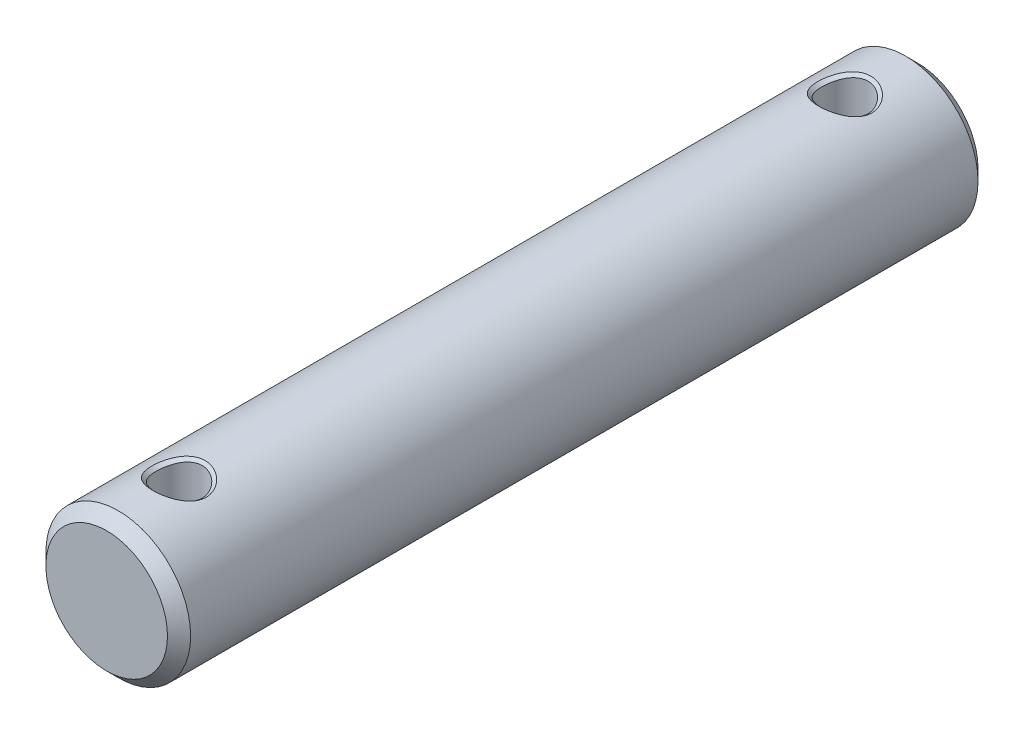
ISO-10303-21;
HEADER;
FILE_DESCRIPTION(('STEP AP214'),'2;1');
FILE_NAME('part.step','',(''),(''),'','','');
FILE_SCHEMA(('AUTOMOTIVE_DESIGN { 1 0 10303 214 1 1 1 1 }'));
ENDSEC;
DATA;
#1=APPLICATION_CONTEXT('core data for automotive mechanical design processes');
#2=APPLICATION_PROTOCOL_DEFINITION('international standard','automotive_design',2000,#1);
#3=PRODUCT_CONTEXT('',#1,'mechanical');
#4=PRODUCT('Part','Part','',(#3));
#5=PRODUCT_RELATED_PRODUCT_CATEGORY('part','',(#4));
#6=PRODUCT_DEFINITION_FORMATION('','',#4);
#7=PRODUCT_DEFINITION_CONTEXT('part definition',#1,'design');
#8=PRODUCT_DEFINITION('design','',#6,#7);
#9=PRODUCT_DEFINITION_SHAPE('','',#8);
#10=(LENGTH_UNIT() NAMED_UNIT(*) SI_UNIT(.MILLI.,.METRE.));
#11=(NAMED_UNIT(*) PLANE_ANGLE_UNIT() SI_UNIT($,.RADIAN.));
#12=(NAMED_UNIT(*) SI_UNIT($,.STERADIAN.) SOLID_ANGLE_UNIT());
#13=UNCERTAINTY_MEASURE_WITH_UNIT(LENGTH_MEASURE(1.E-05),#10,'distance_accuracy_value','');
#14=(GEOMETRIC_REPRESENTATION_CONTEXT(3) GLOBAL_UNCERTAINTY_ASSIGNED_CONTEXT((#13)) GLOBAL_UNIT_ASSIGNED_CONTEXT((#10,
#11,#12)) REPRESENTATION_CONTEXT('',''));
#15=CARTESIAN_POINT('',(0.,0.,0.));
#16=DIRECTION('',(0.,0.,1.));
#17=DIRECTION('',(1.,0.,0.));
#18=AXIS2_PLACEMENT_3D('',#15,#16,#17);
#19=CARTESIAN_POINT('',(0.,0.,140.));
#20=DIRECTION('',(0.,0.,-1.));
#21=DIRECTION('',(-1.,0.,0.));
#22=AXIS2_PLACEMENT_3D('',#19,#20,#21);
#23=CYLINDRICAL_SURFACE('',#22,12.5);
#24=CARTESIAN_POINT('',(0.,-12.5,131.99999994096));
#25=CARTESIAN_POINT('',(-0.0776004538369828,-12.4999889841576,131.999963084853));
#26=CARTESIAN_POINT('',(-0.155195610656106,-12.4991705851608,131.998000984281));
#27=CARTESIAN_POINT('',(-0.309985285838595,-12.4959993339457,131.990294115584));
#28=CARTESIAN_POINT('',(-0.387180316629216,-12.4936500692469,131.984558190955));
#29=CARTESIAN_POINT('',(-0.541010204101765,-12.4875019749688,131.969383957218));
#30=CARTESIAN_POINT('',(-0.617645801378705,-12.4837056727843,131.959952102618));
#31=CARTESIAN_POINT('',(-0.770200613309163,-12.474749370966,131.937468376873));
#32=CARTESIAN_POINT('',(-0.846120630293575,-12.4695911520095,131.92442123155));
#33=CARTESIAN_POINT('',(-0.997087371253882,-12.4579962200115,131.894787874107));
#34=CARTESIAN_POINT('',(-1.07213489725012,-12.4515607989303,131.878205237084));
#35=CARTESIAN_POINT('',(-1.22119999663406,-12.4374965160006,131.841581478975));
#36=CARTESIAN_POINT('',(-1.29521838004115,-12.4298686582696,131.821543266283));
#37=CARTESIAN_POINT('',(-1.44206843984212,-12.4135043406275,131.778088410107));
#38=CARTESIAN_POINT('',(-1.51490099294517,-12.4047687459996,131.754674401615));
#39=CARTESIAN_POINT('',(-1.65922257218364,-12.3862736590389,131.704547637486));
#40=CARTESIAN_POINT('',(-1.73071263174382,-12.3765149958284,131.677837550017));
#41=CARTESIAN_POINT('',(-1.87219229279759,-12.3560583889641,131.621198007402));
#42=CARTESIAN_POINT('',(-1.94218319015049,-12.3453613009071,131.591271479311));
#43=CARTESIAN_POINT('',(-2.08050747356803,-12.3231123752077,131.528278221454));
#44=CARTESIAN_POINT('',(-2.14884252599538,-12.3115614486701,131.495214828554));
#45=CARTESIAN_POINT('',(-2.28369796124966,-12.287689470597,131.426026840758));
#46=CARTESIAN_POINT('',(-2.35022047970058,-12.2753693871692,131.389906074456));
#47=CARTESIAN_POINT('',(-2.48129353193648,-12.2500432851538,131.314682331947));
#48=CARTESIAN_POINT('',(-2.54584674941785,-12.237038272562,131.2755836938));
#49=CARTESIAN_POINT('',(-2.67282399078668,-12.2104281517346,131.194482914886));
#50=CARTESIAN_POINT('',(-2.73525129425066,-12.1968240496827,131.152485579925));
#51=CARTESIAN_POINT('',(-2.85781874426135,-12.1690955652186,131.065667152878));
#52=CARTESIAN_POINT('',(-2.91796277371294,-12.1549721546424,131.020851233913));
#53=CARTESIAN_POINT('',(-3.03580833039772,-12.12630747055,130.928471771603));
#54=CARTESIAN_POINT('',(-3.09351429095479,-12.1117670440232,130.880913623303));
#55=CARTESIAN_POINT('',(-3.20631865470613,-12.0822868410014,130.783139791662));
#56=CARTESIAN_POINT('',(-3.26142194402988,-12.0673479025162,130.732929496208));
#57=CARTESIAN_POINT('',(-3.36889752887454,-12.0374001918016,130.629885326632));
#58=CARTESIAN_POINT('',(-3.42127463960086,-12.0223915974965,130.577056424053));
#59=CARTESIAN_POINT('',(-3.52324893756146,-11.9926522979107,130.468881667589));
#60=CARTESIAN_POINT('',(-3.57285066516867,-11.9779211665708,130.413540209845));
#61=CARTESIAN_POINT('',(-3.66918326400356,-11.9487733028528,130.300502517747));
#62=CARTESIAN_POINT('',(-3.71591887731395,-11.9343560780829,130.242810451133));
#63=CARTESIAN_POINT('',(-3.8064378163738,-11.9059561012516,130.125219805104));
#64=CARTESIAN_POINT('',(-3.85022619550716,-11.8919726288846,130.065325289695));
#65=CARTESIAN_POINT('',(-3.93476651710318,-11.8645379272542,129.943481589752));
#66=CARTESIAN_POINT('',(-3.97552390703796,-11.8510857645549,129.881536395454));
#67=CARTESIAN_POINT('',(-4.05391870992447,-11.8248174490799,129.755742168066));
#68=CARTESIAN_POINT('',(-4.09156198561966,-11.8120001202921,129.691897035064));
#69=CARTESIAN_POINT('',(-4.1636448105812,-11.7871036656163,129.562454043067));
#70=CARTESIAN_POINT('',(-4.19809059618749,-11.7750231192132,129.4968599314));
#71=CARTESIAN_POINT('',(-4.26369478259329,-11.7517028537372,129.364070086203));
#72=CARTESIAN_POINT('',(-4.29485967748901,-11.7404614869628,129.296877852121));
#73=CARTESIAN_POINT('',(-4.35381852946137,-11.7189220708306,129.161042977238));
#74=CARTESIAN_POINT('',(-4.38161903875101,-11.7086221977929,129.092403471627));
#75=CARTESIAN_POINT('',(-4.43376577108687,-11.6890682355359,128.953825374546));
#76=CARTESIAN_POINT('',(-4.45811830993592,-11.6798122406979,128.883889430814));
#77=CARTESIAN_POINT('',(-4.50328606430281,-11.6624483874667,128.742869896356));
#78=CARTESIAN_POINT('',(-4.5241069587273,-11.6543386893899,128.671788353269));
#79=CARTESIAN_POINT('',(-4.56212875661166,-11.6393696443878,128.52862915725));
#80=CARTESIAN_POINT('',(-4.57933418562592,-11.632508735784,128.456552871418));
#81=CARTESIAN_POINT('',(-4.61004306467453,-11.6201391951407,128.311555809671));
#82=CARTESIAN_POINT('',(-4.62354924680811,-11.6146295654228,128.23863569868));
#83=CARTESIAN_POINT('',(-4.64677773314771,-11.6050644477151,128.092102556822));
#84=CARTESIAN_POINT('',(-4.65650021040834,-11.6010088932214,128.018489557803));
#85=CARTESIAN_POINT('',(-4.67208227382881,-11.5944525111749,127.870722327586));
#86=CARTESIAN_POINT('',(-4.677938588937,-11.5919530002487,127.796567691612));
#87=CARTESIAN_POINT('',(-4.68570234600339,-11.5886121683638,127.647867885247));
#88=CARTESIAN_POINT('',(-4.68760207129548,-11.5877740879,127.573322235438));
#89=CARTESIAN_POINT('',(-4.68739744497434,-11.5878463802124,127.424241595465));
#90=CARTESIAN_POINT('',(-4.68529329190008,-11.588756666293,127.349706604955));
#91=CARTESIAN_POINT('',(-4.67716454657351,-11.5922235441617,127.201045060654));
#92=CARTESIAN_POINT('',(-4.67114802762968,-11.5947767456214,127.126917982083));
#93=CARTESIAN_POINT('',(-4.65527417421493,-11.601428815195,126.97921955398));
#94=CARTESIAN_POINT('',(-4.64542053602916,-11.6055261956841,126.905647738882));
#95=CARTESIAN_POINT('',(-4.62195885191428,-11.6151632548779,126.759207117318));
#96=CARTESIAN_POINT('',(-4.60835105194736,-11.6207028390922,126.68633826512));
#97=CARTESIAN_POINT('',(-4.57746442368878,-11.6331223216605,126.541450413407));
#98=CARTESIAN_POINT('',(-4.56018323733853,-11.6400030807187,126.469431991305));
#99=CARTESIAN_POINT('',(-4.52203293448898,-11.6550031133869,126.326391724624));
#100=CARTESIAN_POINT('',(-4.5011595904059,-11.6631238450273,126.255371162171));
#101=CARTESIAN_POINT('',(-4.45590719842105,-11.6805024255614,126.114473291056));
#102=CARTESIAN_POINT('',(-4.43152267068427,-11.6897620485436,126.04459796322));
#103=CARTESIAN_POINT('',(-4.37932957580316,-11.7093172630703,125.906137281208));
#104=CARTESIAN_POINT('',(-4.35151477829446,-11.7196147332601,125.837554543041));
#105=CARTESIAN_POINT('',(-4.29254230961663,-11.7411446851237,125.701825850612));
#106=CARTESIAN_POINT('',(-4.26137804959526,-11.7523789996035,125.634683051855));
#107=CARTESIAN_POINT('',(-4.19578745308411,-11.7756818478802,125.501981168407));
#108=CARTESIAN_POINT('',(-4.16135446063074,-11.7877520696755,125.436425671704));
#109=CARTESIAN_POINT('',(-4.08930689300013,-11.8126259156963,125.307045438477));
#110=CARTESIAN_POINT('',(-4.05168579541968,-11.8254310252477,125.24322462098));
#111=CARTESIAN_POINT('',(-3.97334240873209,-11.8516742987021,125.117460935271));
#112=CARTESIAN_POINT('',(-3.93261385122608,-11.8651137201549,125.055522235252));
#113=CARTESIAN_POINT('',(-3.8481354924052,-11.8925237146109,124.933669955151));
#114=CARTESIAN_POINT('',(-3.80437972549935,-11.9064953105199,124.873760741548));
#115=CARTESIAN_POINT('',(-3.71392808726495,-11.9348736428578,124.756115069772));
#116=CARTESIAN_POINT('',(-3.66722654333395,-11.949281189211,124.698383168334));
#117=CARTESIAN_POINT('',(-3.5709598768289,-11.9784133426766,124.58523823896));
#118=CARTESIAN_POINT('',(-3.52138929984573,-11.9931385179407,124.529829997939));
#119=CARTESIAN_POINT('',(-3.41947848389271,-12.0228703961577,124.421484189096));
#120=CARTESIAN_POINT('',(-3.36713293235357,-12.0378776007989,124.368551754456));
#121=CARTESIAN_POINT('',(-3.25970703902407,-12.0678273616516,124.265293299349));
#122=CARTESIAN_POINT('',(-3.20462152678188,-12.0827697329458,124.214972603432));
#123=CARTESIAN_POINT('',(-3.09182851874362,-12.1122595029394,124.117005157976));
#124=CARTESIAN_POINT('',(-3.03411618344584,-12.1268060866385,124.069363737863));
#125=CARTESIAN_POINT('',(-2.91624141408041,-12.155484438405,123.976837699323));
#126=CARTESIAN_POINT('',(-2.85607455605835,-12.1696153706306,123.931958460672));
#127=CARTESIAN_POINT('',(-2.73344520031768,-12.1973594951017,123.845034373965));
#128=CARTESIAN_POINT('',(-2.67097879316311,-12.210971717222,123.802994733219));
#129=CARTESIAN_POINT('',(-2.54390931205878,-12.2375977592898,123.721829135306));
#130=CARTESIAN_POINT('',(-2.47930291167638,-12.2506105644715,123.682708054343));
#131=CARTESIAN_POINT('',(-2.34811112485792,-12.2759510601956,123.607458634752));
#132=CARTESIAN_POINT('',(-2.28152299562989,-12.2882777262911,123.571334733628));
#133=CARTESIAN_POINT('',(-2.14652577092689,-12.312160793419,123.502158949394));
#134=CARTESIAN_POINT('',(-2.07811447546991,-12.3237161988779,123.469111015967));
#135=CARTESIAN_POINT('',(-1.93962889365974,-12.3459711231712,123.406166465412));
#136=CARTESIAN_POINT('',(-1.86955287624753,-12.3566696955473,123.376273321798));
#137=CARTESIAN_POINT('',(-1.72789592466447,-12.3771254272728,123.319717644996));
#138=CARTESIAN_POINT('',(-1.65631363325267,-12.3868816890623,123.293058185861));
#139=CARTESIAN_POINT('',(-1.51180229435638,-12.4053672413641,123.243049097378));
#140=CARTESIAN_POINT('',(-1.43887215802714,-12.4140956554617,123.219702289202));
#141=CARTESIAN_POINT('',(-1.2918233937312,-12.4304399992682,123.176397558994));
#142=CARTESIAN_POINT('',(-1.21770384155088,-12.4380550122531,123.156442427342));
#143=CARTESIAN_POINT('',(-1.06843460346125,-12.4520870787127,123.119999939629));
#144=CARTESIAN_POINT('',(-0.993284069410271,-12.4585030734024,123.103515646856));
#145=CARTESIAN_POINT('',(-0.842111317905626,-12.4700518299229,123.074093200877));
#146=CARTESIAN_POINT('',(-0.76608827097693,-12.4751832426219,123.061158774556));
#147=CARTESIAN_POINT('',(-0.613328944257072,-12.4840773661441,123.03891484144));
#148=CARTESIAN_POINT('',(-0.536591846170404,-12.4878382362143,123.029610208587));
#149=CARTESIAN_POINT('',(-0.382563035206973,-12.4939073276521,123.01470111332));
#150=CARTESIAN_POINT('',(-0.305270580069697,-12.4962129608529,123.009103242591));
#151=CARTESIAN_POINT('',(-0.150288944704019,-12.4992829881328,123.00169371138));
#152=CARTESIAN_POINT('',(-0.072599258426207,-12.50004371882,122.999891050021));
#153=CARTESIAN_POINT('',(0.0827367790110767,-12.4999542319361,123.00011431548));
#154=CARTESIAN_POINT('',(0.160383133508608,-12.4991047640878,123.002138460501));
#155=CARTESIAN_POINT('',(0.315201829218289,-12.4958830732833,123.009931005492));
#156=CARTESIAN_POINT('',(0.39237489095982,-12.4935158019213,123.015687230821));
#157=CARTESIAN_POINT('',(0.546100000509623,-12.4873394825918,123.030875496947));
#158=CARTESIAN_POINT('',(0.622653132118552,-12.4835341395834,123.040298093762));
#159=CARTESIAN_POINT('',(0.774991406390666,-12.4745672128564,123.062739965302));
#160=CARTESIAN_POINT('',(0.850777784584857,-12.4694083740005,123.075751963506));
#161=CARTESIAN_POINT('',(1.00143582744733,-12.4578183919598,123.105297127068));
#162=CARTESIAN_POINT('',(1.07630875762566,-12.4513892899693,123.121824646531));
#163=CARTESIAN_POINT('',(1.22499325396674,-12.4373428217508,123.158325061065));
#164=CARTESIAN_POINT('',(1.29880606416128,-12.4297269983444,123.178293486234));
#165=CARTESIAN_POINT('',(1.44522370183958,-12.4133908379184,123.221600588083));
#166=CARTESIAN_POINT('',(1.51782975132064,-12.4046717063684,123.244935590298));
#167=CARTESIAN_POINT('',(1.66168722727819,-12.3862125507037,123.294901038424));
#168=CARTESIAN_POINT('',(1.73293988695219,-12.3764735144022,123.321528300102));
#169=CARTESIAN_POINT('',(1.87394389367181,-12.3560580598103,123.37800377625));
#170=CARTESIAN_POINT('',(1.94369653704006,-12.3453824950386,123.407849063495));
#171=CARTESIAN_POINT('',(2.08155375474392,-12.3231773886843,123.470686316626));
#172=CARTESIAN_POINT('',(2.14965974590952,-12.3116486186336,123.503675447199));
#173=CARTESIAN_POINT('',(2.28407684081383,-12.2878205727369,123.572726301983));
#174=CARTESIAN_POINT('',(2.35038953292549,-12.2755220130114,123.608785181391));
#175=CARTESIAN_POINT('',(2.48107313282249,-12.2502374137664,123.683901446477));
#176=CARTESIAN_POINT('',(2.54544583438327,-12.2372520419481,123.722955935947));
#177=CARTESIAN_POINT('',(2.67210259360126,-12.2106784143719,123.803989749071));
#178=CARTESIAN_POINT('',(2.73438865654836,-12.1970907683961,123.845966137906));
#179=CARTESIAN_POINT('',(2.85672498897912,-12.1693913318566,123.932768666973));
#180=CARTESIAN_POINT('',(2.91677744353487,-12.155280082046,123.977591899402));
#181=CARTESIAN_POINT('',(3.03450049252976,-12.1266340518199,124.070018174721));
#182=CARTESIAN_POINT('',(3.09217336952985,-12.1120997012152,124.117618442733));
#183=CARTESIAN_POINT('',(3.20498736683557,-12.0826266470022,124.215509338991));
#184=CARTESIAN_POINT('',(3.26013072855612,-12.067688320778,124.265797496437));
#185=CARTESIAN_POINT('',(3.36771798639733,-12.0377391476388,124.369015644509));
#186=CARTESIAN_POINT('',(3.42016544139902,-12.0227284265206,124.421941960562));
#187=CARTESIAN_POINT('',(3.52225752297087,-11.9929851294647,124.53031397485));
#188=CARTESIAN_POINT('',(3.57190715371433,-11.9782520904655,124.58575483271));
#189=CARTESIAN_POINT('',(3.66832025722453,-11.949101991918,124.698988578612));
#190=CARTESIAN_POINT('',(3.71508885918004,-11.9346844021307,124.756776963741));
#191=CARTESIAN_POINT('',(3.80566009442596,-11.9062843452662,124.874557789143));
#192=CARTESIAN_POINT('',(3.849468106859,-11.8923011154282,124.934545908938));
#193=CARTESIAN_POINT('',(3.93403722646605,-11.8648672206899,125.056573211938));
#194=CARTESIAN_POINT('',(3.9748040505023,-11.851415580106,125.118608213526));
#195=CARTESIAN_POINT('',(4.05321003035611,-11.825148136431,125.244577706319));
#196=CARTESIAN_POINT('',(4.09085527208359,-11.81233111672,125.308508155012));
#197=CARTESIAN_POINT('',(4.16293721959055,-11.7874346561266,125.438116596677));
#198=CARTESIAN_POINT('',(4.19738034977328,-11.7753537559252,125.503790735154));
#199=CARTESIAN_POINT('',(4.26297725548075,-11.7520316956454,125.636734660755));
#200=CARTESIAN_POINT('',(4.29413769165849,-11.7407888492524,125.70400086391));
#201=CARTESIAN_POINT('',(4.35308848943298,-11.7192449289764,125.839976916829));
#202=CARTESIAN_POINT('',(4.38088556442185,-11.7089419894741,125.908683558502));
#203=CARTESIAN_POINT('',(4.43302910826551,-11.6893798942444,126.047388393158));
#204=CARTESIAN_POINT('',(4.4573820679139,-11.6801187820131,126.117383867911));
#205=CARTESIAN_POINT('',(4.50255713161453,-11.662742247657,126.258514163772));
#206=CARTESIAN_POINT('',(4.52338512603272,-11.6546249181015,126.329646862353));
#207=CARTESIAN_POINT('',(4.56143039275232,-11.6396377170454,126.472899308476));
#208=CARTESIAN_POINT('',(4.57865246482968,-11.6327661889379,126.545017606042));
#209=CARTESIAN_POINT('',(4.60940653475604,-11.6203721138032,126.690088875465));
#210=CARTESIAN_POINT('',(4.62294163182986,-11.6148484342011,126.763041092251));
#211=CARTESIAN_POINT('',(4.64624297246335,-11.6052514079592,126.909627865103));
#212=CARTESIAN_POINT('',(4.65600988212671,-11.6011778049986,126.983262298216));
#213=CARTESIAN_POINT('',(4.67169700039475,-11.5945814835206,127.131061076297));
#214=CARTESIAN_POINT('',(4.6776145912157,-11.5920598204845,127.20522574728));
#215=CARTESIAN_POINT('',(4.68552539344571,-11.5886690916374,127.353933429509));
#216=CARTESIAN_POINT('',(4.68751174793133,-11.5878029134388,127.428476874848));
#217=CARTESIAN_POINT('',(4.68748600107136,-11.587818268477,127.577537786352));
#218=CARTESIAN_POINT('',(4.68547524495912,-11.5886992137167,127.652055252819));
#219=CARTESIAN_POINT('',(4.67751814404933,-11.5921117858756,127.800663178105));
#220=CARTESIAN_POINT('',(4.6715811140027,-11.5946395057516,127.874754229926));
#221=CARTESIAN_POINT('',(4.6558580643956,-11.6012432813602,128.022363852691));
#222=CARTESIAN_POINT('',(4.64607677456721,-11.6053174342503,128.09588301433));
#223=CARTESIAN_POINT('',(4.62275138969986,-11.6149107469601,128.242203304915));
#224=CARTESIAN_POINT('',(4.60920838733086,-11.6204294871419,128.315004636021));
#225=CARTESIAN_POINT('',(4.57844464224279,-11.6328095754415,128.459744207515));
#226=CARTESIAN_POINT('',(4.56122221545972,-11.6396715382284,128.531682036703));
#227=CARTESIAN_POINT('',(4.52318387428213,-11.6546359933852,128.674549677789));
#228=CARTESIAN_POINT('',(4.50236425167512,-11.6627397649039,128.745478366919));
#229=CARTESIAN_POINT('',(4.45721501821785,-11.6800861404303,128.886182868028));
#230=CARTESIAN_POINT('',(4.43288031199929,-11.6893303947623,128.955956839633));
#231=CARTESIAN_POINT('',(4.38078379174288,-11.7088563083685,129.094207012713));
#232=CARTESIAN_POINT('',(4.35301601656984,-11.7191397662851,129.162680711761));
#233=CARTESIAN_POINT('',(4.29413573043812,-11.7406428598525,129.298185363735));
#234=CARTESIAN_POINT('',(4.26301680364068,-11.7518642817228,129.365213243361));
#235=CARTESIAN_POINT('',(4.1975161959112,-11.7751422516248,129.49768116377));
#236=CARTESIAN_POINT('',(4.16312795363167,-11.7872004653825,129.563117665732));
#237=CARTESIAN_POINT('',(4.09117037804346,-11.8120509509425,129.692257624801));
#238=CARTESIAN_POINT('',(4.0535945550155,-11.8248447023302,129.755957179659));
#239=CARTESIAN_POINT('',(3.97534335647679,-11.8510656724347,129.881477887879));
#240=CARTESIAN_POINT('',(3.93466169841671,-11.8644941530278,129.943294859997));
#241=CARTESIAN_POINT('',(3.85027993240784,-11.8918824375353,130.064905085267));
#242=CARTESIAN_POINT('',(3.80657381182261,-11.9058432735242,130.124693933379));
#243=CARTESIAN_POINT('',(3.71622531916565,-11.9342000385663,130.242102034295));
#244=CARTESIAN_POINT('',(3.66957720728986,-11.9485967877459,130.299716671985));
#245=CARTESIAN_POINT('',(3.5734226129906,-11.9777070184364,130.412632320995));
#246=CARTESIAN_POINT('',(3.52391060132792,-11.9924210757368,130.46792847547));
#247=CARTESIAN_POINT('',(3.42212231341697,-12.0221303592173,130.57605618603));
#248=CARTESIAN_POINT('',(3.36984065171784,-12.0371260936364,130.628882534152));
#249=CARTESIAN_POINT('',(3.26254168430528,-12.067054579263,130.731950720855));
#250=CARTESIAN_POINT('',(3.20751862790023,-12.0819871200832,130.782186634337));
#251=CARTESIAN_POINT('',(3.0948436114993,-12.1114614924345,130.880019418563));
#252=CARTESIAN_POINT('',(3.03718587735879,-12.126002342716,130.927609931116));
#253=CARTESIAN_POINT('',(2.91941370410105,-12.154673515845,131.020064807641));
#254=CARTESIAN_POINT('',(2.85929411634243,-12.1688028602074,131.064922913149));
#255=CARTESIAN_POINT('',(2.73675416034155,-12.1965478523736,131.151832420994));
#256=CARTESIAN_POINT('',(2.67432933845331,-12.2101623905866,131.193877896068));
#257=CARTESIAN_POINT('',(2.54733907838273,-12.2367969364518,131.275079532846));
#258=CARTESIAN_POINT('',(2.48276992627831,-12.2498158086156,131.31423025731));
#259=CARTESIAN_POINT('',(2.35164998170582,-12.2751721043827,131.389560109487));
#260=CARTESIAN_POINT('',(2.2850961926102,-12.2875084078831,131.425734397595));
#261=CARTESIAN_POINT('',(2.15016628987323,-12.3114142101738,131.495028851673));
#262=CARTESIAN_POINT('',(2.08178783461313,-12.322982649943,131.528144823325));
#263=CARTESIAN_POINT('',(1.94336789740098,-12.3452668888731,131.591240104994));
#264=CARTESIAN_POINT('',(1.87332463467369,-12.355981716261,131.621215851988));
#265=CARTESIAN_POINT('',(1.73173449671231,-12.3764729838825,131.677948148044));
#266=CARTESIAN_POINT('',(1.66018628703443,-12.386248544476,131.704701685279));
#267=CARTESIAN_POINT('',(1.51574577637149,-12.4047754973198,131.754907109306));
#268=CARTESIAN_POINT('',(1.44285246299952,-12.4135260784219,131.778356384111));
#269=CARTESIAN_POINT('',(1.29588138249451,-12.4299173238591,131.821870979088));
#270=CARTESIAN_POINT('',(1.22180280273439,-12.4375571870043,131.841933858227));
#271=CARTESIAN_POINT('',(1.07262095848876,-12.4516413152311,131.878593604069));
#272=CARTESIAN_POINT('',(0.997516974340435,-12.4580846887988,131.89518788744));
#273=CARTESIAN_POINT('',(0.846444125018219,-12.4696902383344,131.924828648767));
#274=CARTESIAN_POINT('',(0.770474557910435,-12.474851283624,131.937871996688));
#275=CARTESIAN_POINT('',(0.617830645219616,-12.4838068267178,131.960329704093));
#276=CARTESIAN_POINT('',(0.541155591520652,-12.4875997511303,131.969739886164));
#277=CARTESIAN_POINT('',(0.387259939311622,-12.4937335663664,131.984849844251));
#278=CARTESIAN_POINT('',(0.310038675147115,-12.4960721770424,131.990543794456));
#279=CARTESIAN_POINT('',(0.155213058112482,-12.4992134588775,131.99814326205));
#280=CARTESIAN_POINT('',(0.0776082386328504,-12.5000128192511,132.000040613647));
#281=CARTESIAN_POINT('',(0.,-12.5,131.99999994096));
#282=B_SPLINE_CURVE_WITH_KNOTS('',3,(#24,#25,#26,#27,#28,#29,#30,#31,#32,#33,#34,#35,#36,#37,
#38,#39,#40,#41,#42,#43,#44,#45,#46,#47,#48,#49,#50,#51,#52,#53,#54,#55,#56,#57,#58,#59,#60,#61,
#62,#63,#64,#65,#66,#67,#68,#69,#70,#71,#72,#73,#74,#75,#76,#77,#78,#79,#80,#81,#82,#83,#84,#85,
#86,#87,#88,#89,#90,#91,#92,#93,#94,#95,#96,#97,#98,#99,#100,#101,#102,#103,#104,#105,#106,#107,
#108,#109,#110,#111,#112,#113,#114,#115,#116,#117,#118,#119,#120,#121,#122,#123,#124,#125,#126,
#127,#128,#129,#130,#131,#132,#133,#134,#135,#136,#137,#138,#139,#140,#141,#142,#143,#144,#145,
#146,#147,#148,#149,#150,#151,#152,#153,#154,#155,#156,#157,#158,#159,#160,#161,#162,#163,#164,
#165,#166,#167,#168,#169,#170,#171,#172,#173,#174,#175,#176,#177,#178,#179,#180,#181,#182,#183,
#184,#185,#186,#187,#188,#189,#190,#191,#192,#193,#194,#195,#196,#197,#198,#199,#200,#201,#202,
#203,#204,#205,#206,#207,#208,#209,#210,#211,#212,#213,#214,#215,#216,#217,#218,#219,#220,#221,
#222,#223,#224,#225,#226,#227,#228,#229,#230,#231,#232,#233,#234,#235,#236,#237,#238,#239,#240,
#241,#242,#243,#244,#245,#246,#247,#248,#249,#250,#251,#252,#253,#254,#255,#256,#257,#258,#259,
#260,#261,#262,#263,#264,#265,#266,#267,#268,#269,#270,#271,#272,#273,#274,#275,#276,#277,#278,
#279,#280,#281),.UNSPECIFIED.,.F.,.F.,(4,2,2,2,2,2,2,2,2,2,2,2,2,2,2,2,2,2,2,2,2,2,2,2,2,2,2,2,
2,2,2,2,2,2,2,2,2,2,2,2,2,2,2,2,2,2,2,2,2,2,2,2,2,2,2,2,2,2,2,2,2,2,2,2,2,2,2,2,2,2,2,2,2,2,2,2,
2,2,2,2,2,2,2,2,2,2,2,2,2,2,2,2,2,2,2,2,2,2,2,2,2,2,2,2,2,2,2,2,2,2,2,2,2,2,2,2,2,2,2,2,2,2,2,2,
2,2,2,2,4),(0.,0.232767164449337,0.46499080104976,0.696810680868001,0.928328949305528,
1.15961420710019,1.39070574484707,1.62161787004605,1.85234428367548,2.08286247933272,
2.31313815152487,2.54312961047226,2.77279220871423,3.00208278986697,3.23096417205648,
3.45940967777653,3.68740771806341,3.91498833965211,4.14218505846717,4.36899512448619,
4.59540583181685,4.82139926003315,5.04695705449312,5.27206525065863,5.49671914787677,
5.72092823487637,5.94472116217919,6.16815074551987,6.39129896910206,6.61428193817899,
6.83725470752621,7.06041588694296,7.28401189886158,7.50759682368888,7.73072183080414,
7.95363243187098,8.17652843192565,8.39956795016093,8.62287177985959,8.84652797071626,
9.07059654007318,9.29511424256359,9.52009934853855,9.74555639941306,9.97148092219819,
10.1978640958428,10.424697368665,10.6519770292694,10.8797087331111,11.1078878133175,
11.3365057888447,11.5655557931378,11.7950150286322,12.0248494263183,12.2550182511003,
12.4854786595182,12.7161902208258,12.947119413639,13.1782441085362,13.409558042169,
13.6410752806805,13.872834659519,14.104904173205,14.3373852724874,14.5704170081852,
14.8033402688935,15.035507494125,15.2670806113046,15.4981876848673,15.7289263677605,
15.9593675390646,16.1895590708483,16.4195296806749,16.6492928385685,16.8788507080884,
17.1081981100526,17.3373265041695,17.5662279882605,17.7948993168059,18.0233459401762,
18.2515860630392,18.4795167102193,18.7070258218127,18.9341174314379,19.16078467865,
19.3870144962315,19.612792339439,19.8381069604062,20.0629552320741,20.2873470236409,
20.5113101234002,20.7348951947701,20.9581807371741,21.1812780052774,21.4043358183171,
21.6275451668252,21.8511434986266,22.0746665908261,22.2976612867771,22.5203824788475,
22.7430390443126,22.9657977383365,23.1887874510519,23.4121037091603,23.6358133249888,
23.8599591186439,24.0845646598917,24.3096389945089,24.5351813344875,24.7611857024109,
24.9876455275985,25.2145581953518,25.441929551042,25.6697997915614,25.8981959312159,
26.1270969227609,26.3564660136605,26.5862555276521,26.8164115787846,27.0468787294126,
27.2776046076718,27.5085445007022,27.7396659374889,27.9709532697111,28.2024122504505,
28.4340745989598,28.6660025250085,28.8982931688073,29.1310828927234),.UNSPECIFIED.);
#283=CARTESIAN_POINT('',(0.,-12.5,131.99999994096));
#284=VERTEX_POINT('',#283);
#285=EDGE_CURVE('E373',#284,#284,#282,.F.);
#286=ORIENTED_EDGE('',*,*,#285,.T.);
#287=EDGE_LOOP('',(#286));
#288=FACE_BOUND('',#287,.T.);
#289=CARTESIAN_POINT('',(0.,12.5,131.99999994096));
#290=CARTESIAN_POINT('',(0.0776004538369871,12.4999889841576,131.999963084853));
#291=CARTESIAN_POINT('',(0.15519561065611,12.4991705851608,131.998000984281));
#292=CARTESIAN_POINT('',(0.309985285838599,12.4959993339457,131.990294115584));
#293=CARTESIAN_POINT('',(0.387180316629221,12.4936500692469,131.984558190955));
#294=CARTESIAN_POINT('',(0.541010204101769,12.4875019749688,131.969383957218));
#295=CARTESIAN_POINT('',(0.61764580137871,12.4837056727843,131.959952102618));
#296=CARTESIAN_POINT('',(0.770200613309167,12.474749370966,131.937468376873));
#297=CARTESIAN_POINT('',(0.846120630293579,12.4695911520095,131.92442123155));
#298=CARTESIAN_POINT('',(0.997087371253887,12.4579962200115,131.894787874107));
#299=CARTESIAN_POINT('',(1.07213489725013,12.4515607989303,131.878205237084));
#300=CARTESIAN_POINT('',(1.22119999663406,12.4374965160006,131.841581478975));
#301=CARTESIAN_POINT('',(1.29521838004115,12.4298686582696,131.821543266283));
#302=CARTESIAN_POINT('',(1.44206843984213,12.4135043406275,131.778088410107));
#303=CARTESIAN_POINT('',(1.51490099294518,12.4047687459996,131.754674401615));
#304=CARTESIAN_POINT('',(1.65922257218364,12.3862736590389,131.704547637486));
#305=CARTESIAN_POINT('',(1.73071263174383,12.3765149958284,131.677837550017));
#306=CARTESIAN_POINT('',(1.8721922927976,12.3560583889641,131.621198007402));
#307=CARTESIAN_POINT('',(1.9421831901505,12.3453613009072,131.591271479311));
#308=CARTESIAN_POINT('',(2.08050747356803,12.3231123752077,131.528278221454));
#309=CARTESIAN_POINT('',(2.14884252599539,12.3115614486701,131.495214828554));
#310=CARTESIAN_POINT('',(2.28369796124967,12.2876894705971,131.426026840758));
#311=CARTESIAN_POINT('',(2.35022047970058,12.2753693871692,131.389906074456));
#312=CARTESIAN_POINT('',(2.48129353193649,12.2500432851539,131.314682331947));
#313=CARTESIAN_POINT('',(2.54584674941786,12.237038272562,131.2755836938));
#314=CARTESIAN_POINT('',(2.67282399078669,12.2104281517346,131.194482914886));
#315=CARTESIAN_POINT('',(2.73525129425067,12.1968240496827,131.152485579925));
#316=CARTESIAN_POINT('',(2.85781874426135,12.1690955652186,131.065667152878));
#317=CARTESIAN_POINT('',(2.91796277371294,12.1549721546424,131.020851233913));
#318=CARTESIAN_POINT('',(3.03580833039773,12.12630747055,130.928471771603));
#319=CARTESIAN_POINT('',(3.0935142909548,12.1117670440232,130.880913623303));
#320=CARTESIAN_POINT('',(3.20631865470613,12.0822868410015,130.783139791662));
#321=CARTESIAN_POINT('',(3.26142194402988,12.0673479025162,130.732929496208));
#322=CARTESIAN_POINT('',(3.36889752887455,12.0374001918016,130.629885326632));
#323=CARTESIAN_POINT('',(3.42127463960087,12.0223915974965,130.577056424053));
#324=CARTESIAN_POINT('',(3.52324893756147,11.9926522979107,130.468881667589));
#325=CARTESIAN_POINT('',(3.57285066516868,11.9779211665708,130.413540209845));
#326=CARTESIAN_POINT('',(3.66918326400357,11.9487733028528,130.300502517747));
#327=CARTESIAN_POINT('',(3.71591887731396,11.9343560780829,130.242810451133));
#328=CARTESIAN_POINT('',(3.80643781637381,11.9059561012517,130.125219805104));
#329=CARTESIAN_POINT('',(3.85022619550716,11.8919726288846,130.065325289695));
#330=CARTESIAN_POINT('',(3.93476651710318,11.8645379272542,129.943481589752));
#331=CARTESIAN_POINT('',(3.97552390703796,11.8510857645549,129.881536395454));
#332=CARTESIAN_POINT('',(4.05391870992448,11.8248174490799,129.755742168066));
#333=CARTESIAN_POINT('',(4.09156198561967,11.8120001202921,129.691897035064));
#334=CARTESIAN_POINT('',(4.16364481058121,11.7871036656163,129.562454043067));
#335=CARTESIAN_POINT('',(4.1980905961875,11.7750231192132,129.4968599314));
#336=CARTESIAN_POINT('',(4.2636947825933,11.7517028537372,129.364070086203));
#337=CARTESIAN_POINT('',(4.29485967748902,11.7404614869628,129.296877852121));
#338=CARTESIAN_POINT('',(4.35381852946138,11.7189220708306,129.161042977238));
#339=CARTESIAN_POINT('',(4.38161903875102,11.7086221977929,129.092403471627));
#340=CARTESIAN_POINT('',(4.43376577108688,11.6890682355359,128.953825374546));
#341=CARTESIAN_POINT('',(4.45811830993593,11.6798122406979,128.883889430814));
#342=CARTESIAN_POINT('',(4.50328606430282,11.6624483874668,128.742869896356));
#343=CARTESIAN_POINT('',(4.52410695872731,11.6543386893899,128.671788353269));
#344=CARTESIAN_POINT('',(4.56212875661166,11.6393696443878,128.52862915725));
#345=CARTESIAN_POINT('',(4.57933418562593,11.632508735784,128.456552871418));
#346=CARTESIAN_POINT('',(4.61004306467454,11.6201391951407,128.311555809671));
#347=CARTESIAN_POINT('',(4.62354924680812,11.6146295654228,128.23863569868));
#348=CARTESIAN_POINT('',(4.64677773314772,11.6050644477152,128.092102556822));
#349=CARTESIAN_POINT('',(4.65650021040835,11.6010088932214,128.018489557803));
#350=CARTESIAN_POINT('',(4.67208227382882,11.5944525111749,127.870722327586));
#351=CARTESIAN_POINT('',(4.67793858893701,11.5919530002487,127.796567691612));
#352=CARTESIAN_POINT('',(4.6857023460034,11.5886121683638,127.647867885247));
#353=CARTESIAN_POINT('',(4.68760207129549,11.5877740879,127.573322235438));
#354=CARTESIAN_POINT('',(4.68739744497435,11.5878463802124,127.424241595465));
#355=CARTESIAN_POINT('',(4.68529329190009,11.588756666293,127.349706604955));
#356=CARTESIAN_POINT('',(4.67716454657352,11.5922235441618,127.201045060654));
#357=CARTESIAN_POINT('',(4.67114802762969,11.5947767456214,127.126917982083));
#358=CARTESIAN_POINT('',(4.65527417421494,11.601428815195,126.97921955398));
#359=CARTESIAN_POINT('',(4.64542053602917,11.6055261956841,126.905647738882));
#360=CARTESIAN_POINT('',(4.62195885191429,11.6151632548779,126.759207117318));
#361=CARTESIAN_POINT('',(4.60835105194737,11.6207028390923,126.68633826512));
#362=CARTESIAN_POINT('',(4.57746442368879,11.6331223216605,126.541450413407));
#363=CARTESIAN_POINT('',(4.56018323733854,11.6400030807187,126.469431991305));
#364=CARTESIAN_POINT('',(4.52203293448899,11.6550031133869,126.326391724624));
#365=CARTESIAN_POINT('',(4.50115959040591,11.6631238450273,126.255371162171));
#366=CARTESIAN_POINT('',(4.45590719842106,11.6805024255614,126.114473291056));
#367=CARTESIAN_POINT('',(4.43152267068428,11.6897620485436,126.04459796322));
#368=CARTESIAN_POINT('',(4.37932957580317,11.7093172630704,125.906137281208));
#369=CARTESIAN_POINT('',(4.35151477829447,11.7196147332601,125.837554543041));
#370=CARTESIAN_POINT('',(4.29254230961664,11.7411446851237,125.701825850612));
#371=CARTESIAN_POINT('',(4.26137804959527,11.7523789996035,125.634683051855));
#372=CARTESIAN_POINT('',(4.19578745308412,11.7756818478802,125.501981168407));
#373=CARTESIAN_POINT('',(4.16135446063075,11.7877520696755,125.436425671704));
#374=CARTESIAN_POINT('',(4.08930689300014,11.8126259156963,125.307045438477));
#375=CARTESIAN_POINT('',(4.05168579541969,11.8254310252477,125.24322462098));
#376=CARTESIAN_POINT('',(3.9733424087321,11.8516742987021,125.117460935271));
#377=CARTESIAN_POINT('',(3.93261385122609,11.8651137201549,125.055522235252));
#378=CARTESIAN_POINT('',(3.84813549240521,11.8925237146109,124.933669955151));
#379=CARTESIAN_POINT('',(3.80437972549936,11.90649531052,124.873760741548));
#380=CARTESIAN_POINT('',(3.71392808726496,11.9348736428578,124.756115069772));
#381=CARTESIAN_POINT('',(3.66722654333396,11.949281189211,124.698383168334));
#382=CARTESIAN_POINT('',(3.57095987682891,11.9784133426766,124.58523823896));
#383=CARTESIAN_POINT('',(3.52138929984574,11.9931385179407,124.529829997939));
#384=CARTESIAN_POINT('',(3.41947848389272,12.0228703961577,124.421484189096));
#385=CARTESIAN_POINT('',(3.36713293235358,12.0378776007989,124.368551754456));
#386=CARTESIAN_POINT('',(3.25970703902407,12.0678273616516,124.265293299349));
#387=CARTESIAN_POINT('',(3.20462152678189,12.0827697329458,124.214972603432));
#388=CARTESIAN_POINT('',(3.09182851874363,12.1122595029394,124.117005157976));
#389=CARTESIAN_POINT('',(3.03411618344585,12.1268060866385,124.069363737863));
#390=CARTESIAN_POINT('',(2.91624141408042,12.155484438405,123.976837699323));
#391=CARTESIAN_POINT('',(2.85607455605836,12.1696153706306,123.931958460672));
#392=CARTESIAN_POINT('',(2.73344520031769,12.1973594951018,123.845034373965));
#393=CARTESIAN_POINT('',(2.67097879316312,12.210971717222,123.802994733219));
#394=CARTESIAN_POINT('',(2.54390931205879,12.2375977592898,123.721829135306));
#395=CARTESIAN_POINT('',(2.47930291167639,12.2506105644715,123.682708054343));
#396=CARTESIAN_POINT('',(2.34811112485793,12.2759510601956,123.607458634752));
#397=CARTESIAN_POINT('',(2.2815229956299,12.2882777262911,123.571334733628));
#398=CARTESIAN_POINT('',(2.14652577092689,12.312160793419,123.502158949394));
#399=CARTESIAN_POINT('',(2.07811447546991,12.323716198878,123.469111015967));
#400=CARTESIAN_POINT('',(1.93962889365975,12.3459711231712,123.406166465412));
#401=CARTESIAN_POINT('',(1.86955287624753,12.3566696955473,123.376273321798));
#402=CARTESIAN_POINT('',(1.72789592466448,12.3771254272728,123.319717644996));
#403=CARTESIAN_POINT('',(1.65631363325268,12.3868816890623,123.293058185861));
#404=CARTESIAN_POINT('',(1.51180229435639,12.4053672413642,123.243049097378));
#405=CARTESIAN_POINT('',(1.43887215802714,12.4140956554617,123.219702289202));
#406=CARTESIAN_POINT('',(1.29182339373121,12.4304399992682,123.176397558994));
#407=CARTESIAN_POINT('',(1.21770384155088,12.4380550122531,123.156442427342));
#408=CARTESIAN_POINT('',(1.06843460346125,12.4520870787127,123.119999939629));
#409=CARTESIAN_POINT('',(0.993284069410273,12.4585030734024,123.103515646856));
#410=CARTESIAN_POINT('',(0.842111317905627,12.4700518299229,123.074093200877));
#411=CARTESIAN_POINT('',(0.76608827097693,12.4751832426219,123.061158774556));
#412=CARTESIAN_POINT('',(0.613328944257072,12.4840773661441,123.03891484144));
#413=CARTESIAN_POINT('',(0.536591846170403,12.4878382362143,123.029610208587));
#414=CARTESIAN_POINT('',(0.382563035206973,12.4939073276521,123.01470111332));
#415=CARTESIAN_POINT('',(0.305270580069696,12.4962129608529,123.009103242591));
#416=CARTESIAN_POINT('',(0.150288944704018,12.4992829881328,123.00169371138));
#417=CARTESIAN_POINT('',(0.0725992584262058,12.50004371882,122.999891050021));
#418=CARTESIAN_POINT('',(-0.0827367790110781,12.4999542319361,123.00011431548));
#419=CARTESIAN_POINT('',(-0.16038313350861,12.4991047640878,123.002138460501));
#420=CARTESIAN_POINT('',(-0.31520182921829,12.4958830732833,123.009931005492));
#421=CARTESIAN_POINT('',(-0.392374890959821,12.4935158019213,123.015687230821));
#422=CARTESIAN_POINT('',(-0.546100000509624,12.4873394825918,123.030875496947));
#423=CARTESIAN_POINT('',(-0.622653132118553,12.4835341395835,123.040298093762));
#424=CARTESIAN_POINT('',(-0.774991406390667,12.4745672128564,123.062739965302));
#425=CARTESIAN_POINT('',(-0.850777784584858,12.4694083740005,123.075751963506));
#426=CARTESIAN_POINT('',(-1.00143582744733,12.4578183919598,123.105297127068));
#427=CARTESIAN_POINT('',(-1.07630875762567,12.4513892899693,123.121824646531));
#428=CARTESIAN_POINT('',(-1.22499325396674,12.4373428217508,123.158325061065));
#429=CARTESIAN_POINT('',(-1.29880606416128,12.4297269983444,123.178293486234));
#430=CARTESIAN_POINT('',(-1.44522370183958,12.4133908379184,123.221600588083));
#431=CARTESIAN_POINT('',(-1.51782975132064,12.4046717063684,123.244935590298));
#432=CARTESIAN_POINT('',(-1.66168722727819,12.3862125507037,123.294901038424));
#433=CARTESIAN_POINT('',(-1.73293988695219,12.3764735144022,123.321528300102));
#434=CARTESIAN_POINT('',(-1.87394389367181,12.3560580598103,123.37800377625));
#435=CARTESIAN_POINT('',(-1.94369653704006,12.3453824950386,123.407849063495));
#436=CARTESIAN_POINT('',(-2.08155375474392,12.3231773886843,123.470686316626));
#437=CARTESIAN_POINT('',(-2.14965974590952,12.3116486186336,123.503675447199));
#438=CARTESIAN_POINT('',(-2.28407684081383,12.2878205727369,123.572726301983));
#439=CARTESIAN_POINT('',(-2.35038953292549,12.2755220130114,123.608785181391));
#440=CARTESIAN_POINT('',(-2.48107313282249,12.2502374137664,123.683901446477));
#441=CARTESIAN_POINT('',(-2.54544583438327,12.2372520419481,123.722955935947));
#442=CARTESIAN_POINT('',(-2.67210259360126,12.2106784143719,123.803989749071));
#443=CARTESIAN_POINT('',(-2.73438865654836,12.1970907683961,123.845966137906));
#444=CARTESIAN_POINT('',(-2.85672498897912,12.1693913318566,123.932768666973));
#445=CARTESIAN_POINT('',(-2.91677744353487,12.155280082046,123.977591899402));
#446=CARTESIAN_POINT('',(-3.03450049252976,12.1266340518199,124.070018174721));
#447=CARTESIAN_POINT('',(-3.09217336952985,12.1120997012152,124.117618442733));
#448=CARTESIAN_POINT('',(-3.20498736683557,12.0826266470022,124.215509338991));
#449=CARTESIAN_POINT('',(-3.26013072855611,12.067688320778,124.265797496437));
#450=CARTESIAN_POINT('',(-3.36771798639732,12.0377391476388,124.369015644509));
#451=CARTESIAN_POINT('',(-3.42016544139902,12.0227284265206,124.421941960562));
#452=CARTESIAN_POINT('',(-3.52225752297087,11.9929851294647,124.53031397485));
#453=CARTESIAN_POINT('',(-3.57190715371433,11.9782520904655,124.58575483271));
#454=CARTESIAN_POINT('',(-3.66832025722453,11.949101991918,124.698988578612));
#455=CARTESIAN_POINT('',(-3.71508885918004,11.9346844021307,124.756776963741));
#456=CARTESIAN_POINT('',(-3.80566009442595,11.9062843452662,124.874557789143));
#457=CARTESIAN_POINT('',(-3.849468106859,11.8923011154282,124.934545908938));
#458=CARTESIAN_POINT('',(-3.93403722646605,11.8648672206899,125.056573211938));
#459=CARTESIAN_POINT('',(-3.9748040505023,11.8514155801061,125.118608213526));
#460=CARTESIAN_POINT('',(-4.05321003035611,11.8251481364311,125.244577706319));
#461=CARTESIAN_POINT('',(-4.09085527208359,11.81233111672,125.308508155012));
#462=CARTESIAN_POINT('',(-4.16293721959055,11.7874346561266,125.438116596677));
#463=CARTESIAN_POINT('',(-4.19738034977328,11.7753537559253,125.503790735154));
#464=CARTESIAN_POINT('',(-4.26297725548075,11.7520316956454,125.636734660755));
#465=CARTESIAN_POINT('',(-4.29413769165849,11.7407888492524,125.70400086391));
#466=CARTESIAN_POINT('',(-4.35308848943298,11.7192449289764,125.839976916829));
#467=CARTESIAN_POINT('',(-4.38088556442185,11.7089419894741,125.908683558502));
#468=CARTESIAN_POINT('',(-4.43302910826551,11.6893798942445,126.047388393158));
#469=CARTESIAN_POINT('',(-4.45738206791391,11.6801187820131,126.117383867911));
#470=CARTESIAN_POINT('',(-4.50255713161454,11.662742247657,126.258514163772));
#471=CARTESIAN_POINT('',(-4.52338512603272,11.6546249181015,126.329646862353));
#472=CARTESIAN_POINT('',(-4.56143039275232,11.6396377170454,126.472899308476));
#473=CARTESIAN_POINT('',(-4.57865246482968,11.6327661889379,126.545017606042));
#474=CARTESIAN_POINT('',(-4.60940653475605,11.6203721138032,126.690088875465));
#475=CARTESIAN_POINT('',(-4.62294163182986,11.6148484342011,126.763041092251));
#476=CARTESIAN_POINT('',(-4.64624297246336,11.6052514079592,126.909627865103));
#477=CARTESIAN_POINT('',(-4.65600988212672,11.6011778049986,126.983262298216));
#478=CARTESIAN_POINT('',(-4.67169700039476,11.5945814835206,127.131061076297));
#479=CARTESIAN_POINT('',(-4.67761459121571,11.5920598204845,127.20522574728));
#480=CARTESIAN_POINT('',(-4.68552539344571,11.5886690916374,127.353933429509));
#481=CARTESIAN_POINT('',(-4.68751174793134,11.5878029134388,127.428476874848));
#482=CARTESIAN_POINT('',(-4.68748600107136,11.587818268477,127.577537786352));
#483=CARTESIAN_POINT('',(-4.68547524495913,11.5886992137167,127.652055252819));
#484=CARTESIAN_POINT('',(-4.67751814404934,11.5921117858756,127.800663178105));
#485=CARTESIAN_POINT('',(-4.67158111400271,11.5946395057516,127.874754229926));
#486=CARTESIAN_POINT('',(-4.65585806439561,11.6012432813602,128.022363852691));
#487=CARTESIAN_POINT('',(-4.64607677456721,11.6053174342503,128.09588301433));
#488=CARTESIAN_POINT('',(-4.62275138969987,11.6149107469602,128.242203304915));
#489=CARTESIAN_POINT('',(-4.60920838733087,11.6204294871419,128.315004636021));
#490=CARTESIAN_POINT('',(-4.5784446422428,11.6328095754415,128.459744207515));
#491=CARTESIAN_POINT('',(-4.56122221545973,11.6396715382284,128.531682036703));
#492=CARTESIAN_POINT('',(-4.52318387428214,11.6546359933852,128.674549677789));
#493=CARTESIAN_POINT('',(-4.50236425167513,11.6627397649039,128.745478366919));
#494=CARTESIAN_POINT('',(-4.45721501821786,11.6800861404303,128.886182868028));
#495=CARTESIAN_POINT('',(-4.4328803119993,11.6893303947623,128.955956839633));
#496=CARTESIAN_POINT('',(-4.38078379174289,11.7088563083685,129.094207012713));
#497=CARTESIAN_POINT('',(-4.35301601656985,11.7191397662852,129.162680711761));
#498=CARTESIAN_POINT('',(-4.29413573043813,11.7406428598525,129.298185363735));
#499=CARTESIAN_POINT('',(-4.26301680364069,11.7518642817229,129.365213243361));
#500=CARTESIAN_POINT('',(-4.1975161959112,11.7751422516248,129.49768116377));
#501=CARTESIAN_POINT('',(-4.16312795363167,11.7872004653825,129.563117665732));
#502=CARTESIAN_POINT('',(-4.09117037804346,11.8120509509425,129.692257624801));
#503=CARTESIAN_POINT('',(-4.0535945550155,11.8248447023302,129.755957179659));
#504=CARTESIAN_POINT('',(-3.9753433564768,11.8510656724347,129.881477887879));
#505=CARTESIAN_POINT('',(-3.93466169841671,11.8644941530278,129.943294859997));
#506=CARTESIAN_POINT('',(-3.85027993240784,11.8918824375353,130.064905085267));
#507=CARTESIAN_POINT('',(-3.80657381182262,11.9058432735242,130.124693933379));
#508=CARTESIAN_POINT('',(-3.71622531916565,11.9342000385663,130.242102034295));
#509=CARTESIAN_POINT('',(-3.66957720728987,11.9485967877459,130.299716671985));
#510=CARTESIAN_POINT('',(-3.5734226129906,11.9777070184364,130.412632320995));
#511=CARTESIAN_POINT('',(-3.52391060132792,11.9924210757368,130.46792847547));
#512=CARTESIAN_POINT('',(-3.42212231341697,12.0221303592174,130.57605618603));
#513=CARTESIAN_POINT('',(-3.36984065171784,12.0371260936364,130.628882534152));
#514=CARTESIAN_POINT('',(-3.26254168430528,12.067054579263,130.731950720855));
#515=CARTESIAN_POINT('',(-3.20751862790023,12.0819871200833,130.782186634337));
#516=CARTESIAN_POINT('',(-3.0948436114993,12.1114614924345,130.880019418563));
#517=CARTESIAN_POINT('',(-3.03718587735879,12.126002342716,130.927609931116));
#518=CARTESIAN_POINT('',(-2.91941370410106,12.154673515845,131.020064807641));
#519=CARTESIAN_POINT('',(-2.85929411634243,12.1688028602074,131.064922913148));
#520=CARTESIAN_POINT('',(-2.73675416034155,12.1965478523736,131.151832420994));
#521=CARTESIAN_POINT('',(-2.67432933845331,12.2101623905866,131.193877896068));
#522=CARTESIAN_POINT('',(-2.54733907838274,12.2367969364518,131.275079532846));
#523=CARTESIAN_POINT('',(-2.48276992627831,12.2498158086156,131.31423025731));
#524=CARTESIAN_POINT('',(-2.35164998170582,12.2751721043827,131.389560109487));
#525=CARTESIAN_POINT('',(-2.2850961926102,12.2875084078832,131.425734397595));
#526=CARTESIAN_POINT('',(-2.15016628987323,12.3114142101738,131.495028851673));
#527=CARTESIAN_POINT('',(-2.08178783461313,12.322982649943,131.528144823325));
#528=CARTESIAN_POINT('',(-1.94336789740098,12.3452668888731,131.591240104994));
#529=CARTESIAN_POINT('',(-1.87332463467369,12.355981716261,131.621215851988));
#530=CARTESIAN_POINT('',(-1.73173449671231,12.3764729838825,131.677948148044));
#531=CARTESIAN_POINT('',(-1.66018628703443,12.386248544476,131.704701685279));
#532=CARTESIAN_POINT('',(-1.51574577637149,12.4047754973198,131.754907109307));
#533=CARTESIAN_POINT('',(-1.44285246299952,12.4135260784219,131.778356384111));
#534=CARTESIAN_POINT('',(-1.29588138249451,12.4299173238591,131.821870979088));
#535=CARTESIAN_POINT('',(-1.22180280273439,12.4375571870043,131.841933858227));
#536=CARTESIAN_POINT('',(-1.07262095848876,12.4516413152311,131.878593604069));
#537=CARTESIAN_POINT('',(-0.997516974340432,12.4580846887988,131.89518788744));
#538=CARTESIAN_POINT('',(-0.846444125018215,12.4696902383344,131.924828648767));
#539=CARTESIAN_POINT('',(-0.770474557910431,12.474851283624,131.937871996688));
#540=CARTESIAN_POINT('',(-0.617830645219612,12.4838068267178,131.960329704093));
#541=CARTESIAN_POINT('',(-0.541155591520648,12.4875997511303,131.969739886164));
#542=CARTESIAN_POINT('',(-0.387259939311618,12.4937335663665,131.984849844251));
#543=CARTESIAN_POINT('',(-0.310038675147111,12.4960721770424,131.990543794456));
#544=CARTESIAN_POINT('',(-0.155213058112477,12.4992134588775,131.99814326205));
#545=CARTESIAN_POINT('',(-0.0776082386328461,12.5000128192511,132.000040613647));
#546=CARTESIAN_POINT('',(0.,12.5,131.99999994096));
#547=B_SPLINE_CURVE_WITH_KNOTS('',3,(#289,#290,#291,#292,#293,#294,#295,#296,#297,#298,#299,
#300,#301,#302,#303,#304,#305,#306,#307,#308,#309,#310,#311,#312,#313,#314,#315,#316,#317,#318,
#319,#320,#321,#322,#323,#324,#325,#326,#327,#328,#329,#330,#331,#332,#333,#334,#335,#336,#337,
#338,#339,#340,#341,#342,#343,#344,#345,#346,#347,#348,#349,#350,#351,#352,#353,#354,#355,#356,
#357,#358,#359,#360,#361,#362,#363,#364,#365,#366,#367,#368,#369,#370,#371,#372,#373,#374,#375,
#376,#377,#378,#379,#380,#381,#382,#383,#384,#385,#386,#387,#388,#389,#390,#391,#392,#393,#394,
#395,#396,#397,#398,#399,#400,#401,#402,#403,#404,#405,#406,#407,#408,#409,#410,#411,#412,#413,
#414,#415,#416,#417,#418,#419,#420,#421,#422,#423,#424,#425,#426,#427,#428,#429,#430,#431,#432,
#433,#434,#435,#436,#437,#438,#439,#440,#441,#442,#443,#444,#445,#446,#447,#448,#449,#450,#451,
#452,#453,#454,#455,#456,#457,#458,#459,#460,#461,#462,#463,#464,#465,#466,#467,#468,#469,#470,
#471,#472,#473,#474,#475,#476,#477,#478,#479,#480,#481,#482,#483,#484,#485,#486,#487,#488,#489,
#490,#491,#492,#493,#494,#495,#496,#497,#498,#499,#500,#501,#502,#503,#504,#505,#506,#507,#508,
#509,#510,#511,#512,#513,#514,#515,#516,#517,#518,#519,#520,#521,#522,#523,#524,#525,#526,#527,
#528,#529,#530,#531,#532,#533,#534,#535,#536,#537,#538,#539,#540,#541,#542,#543,#544,#545,#546),
.UNSPECIFIED.,.F.,.F.,(4,2,2,2,2,2,2,2,2,2,2,2,2,2,2,2,2,2,2,2,2,2,2,2,2,2,2,2,2,2,2,2,2,2,2,2,
2,2,2,2,2,2,2,2,2,2,2,2,2,2,2,2,2,2,2,2,2,2,2,2,2,2,2,2,2,2,2,2,2,2,2,2,2,2,2,2,2,2,2,2,2,2,2,2,
2,2,2,2,2,2,2,2,2,2,2,2,2,2,2,2,2,2,2,2,2,2,2,2,2,2,2,2,2,2,2,2,2,2,2,2,2,2,2,2,2,2,2,2,4),(0.,
0.232767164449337,0.46499080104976,0.696810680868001,0.928328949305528,1.15961420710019,
1.39070574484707,1.62161787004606,1.85234428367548,2.08286247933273,2.31313815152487,
2.54312961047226,2.77279220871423,3.00208278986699,3.23096417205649,3.45940967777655,
3.68740771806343,3.91498833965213,4.14218505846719,4.3689951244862,4.59540583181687,
4.82139926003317,5.04695705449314,5.27206525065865,5.49671914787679,5.72092823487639,
5.94472116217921,6.16815074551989,6.39129896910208,6.61428193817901,6.83725470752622,
7.06041588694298,7.2840118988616,7.5075968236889,7.73072183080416,7.953632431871,
8.17652843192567,8.39956795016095,8.62287177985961,8.84652797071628,9.0705965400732,
9.29511424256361,9.52009934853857,9.74555639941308,9.97148092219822,10.1978640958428,
10.424697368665,10.6519770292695,10.8797087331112,11.1078878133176,11.3365057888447,
11.5655557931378,11.7950150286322,12.0248494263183,12.2550182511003,12.4854786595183,
12.7161902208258,12.9471194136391,13.1782441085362,13.4095580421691,13.6410752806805,
13.872834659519,14.104904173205,14.3373852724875,14.5704170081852,14.8033402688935,
15.035507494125,15.2670806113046,15.4981876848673,15.7289263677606,15.9593675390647,
16.1895590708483,16.4195296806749,16.6492928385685,16.8788507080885,17.1081981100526,
17.3373265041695,17.5662279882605,17.7948993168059,18.0233459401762,18.2515860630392,
18.4795167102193,18.7070258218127,18.9341174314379,19.16078467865,19.3870144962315,
19.612792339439,19.8381069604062,20.0629552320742,20.287347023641,20.5113101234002,
20.7348951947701,20.9581807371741,21.1812780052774,21.4043358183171,21.6275451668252,
21.8511434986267,22.0746665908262,22.2976612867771,22.5203824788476,22.7430390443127,
22.9657977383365,23.188787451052,23.4121037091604,23.6358133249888,23.8599591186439,
24.0845646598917,24.309638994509,24.5351813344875,24.761185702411,24.9876455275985,
25.2145581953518,25.441929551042,25.6697997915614,25.8981959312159,26.1270969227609,
26.3564660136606,26.5862555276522,26.8164115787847,27.0468787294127,27.2776046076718,
27.5085445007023,27.739665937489,27.9709532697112,28.2024122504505,28.4340745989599,
28.6660025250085,28.8982931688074,29.1310828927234),.UNSPECIFIED.);
#548=CARTESIAN_POINT('',(0.,12.5,131.99999994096));
#549=VERTEX_POINT('',#548);
#550=EDGE_CURVE('E378',#549,#549,#547,.F.);
#551=ORIENTED_EDGE('',*,*,#550,.T.);
#552=EDGE_LOOP('',(#551));
#553=FACE_BOUND('',#552,.T.);
#554=CARTESIAN_POINT('',(0.,-12.5,16.9999999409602));
#555=CARTESIAN_POINT('',(-0.0776004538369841,-12.4999889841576,16.9999630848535));
#556=CARTESIAN_POINT('',(-0.155195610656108,-12.4991705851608,16.9980009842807));
#557=CARTESIAN_POINT('',(-0.309985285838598,-12.4959993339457,16.9902941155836));
#558=CARTESIAN_POINT('',(-0.38718031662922,-12.4936500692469,16.9845581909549));
#559=CARTESIAN_POINT('',(-0.54101020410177,-12.4875019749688,16.9693839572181));
#560=CARTESIAN_POINT('',(-0.617645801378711,-12.4837056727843,16.9599521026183));
#561=CARTESIAN_POINT('',(-0.77020061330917,-12.474749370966,16.9374683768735));
#562=CARTESIAN_POINT('',(-0.846120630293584,-12.4695911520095,16.9244212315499));
#563=CARTESIAN_POINT('',(-0.99708737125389,-12.4579962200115,16.8947878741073));
#564=CARTESIAN_POINT('',(-1.07213489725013,-12.4515607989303,16.878205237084));
#565=CARTESIAN_POINT('',(-1.22119999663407,-12.4374965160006,16.8415814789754));
#566=CARTESIAN_POINT('',(-1.29521838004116,-12.4298686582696,16.8215432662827));
#567=CARTESIAN_POINT('',(-1.44206843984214,-12.4135043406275,16.7780884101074));
#568=CARTESIAN_POINT('',(-1.51490099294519,-12.4047687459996,16.7546744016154));
#569=CARTESIAN_POINT('',(-1.65922257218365,-12.3862736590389,16.7045476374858));
#570=CARTESIAN_POINT('',(-1.73071263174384,-12.3765149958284,16.6778375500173));
#571=CARTESIAN_POINT('',(-1.87219229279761,-12.3560583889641,16.6211980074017));
#572=CARTESIAN_POINT('',(-1.94218319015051,-12.3453613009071,16.5912714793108));
#573=CARTESIAN_POINT('',(-2.08050747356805,-12.3231123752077,16.5282782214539));
#574=CARTESIAN_POINT('',(-2.1488425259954,-12.3115614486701,16.4952148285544));
#575=CARTESIAN_POINT('',(-2.28369796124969,-12.287689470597,16.426026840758));
#576=CARTESIAN_POINT('',(-2.3502204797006,-12.2753693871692,16.3899060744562));
#577=CARTESIAN_POINT('',(-2.48129353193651,-12.2500432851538,16.3146823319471));
#578=CARTESIAN_POINT('',(-2.54584674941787,-12.237038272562,16.2755836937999));
#579=CARTESIAN_POINT('',(-2.67282399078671,-12.2104281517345,16.1944829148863));
#580=CARTESIAN_POINT('',(-2.73525129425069,-12.1968240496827,16.1524855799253));
#581=CARTESIAN_POINT('',(-2.85781874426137,-12.1690955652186,16.0656671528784));
#582=CARTESIAN_POINT('',(-2.91796277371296,-12.1549721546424,16.0208512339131));
#583=CARTESIAN_POINT('',(-3.03580833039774,-12.12630747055,15.928471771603));
#584=CARTESIAN_POINT('',(-3.09351429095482,-12.1117670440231,15.880913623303));
#585=CARTESIAN_POINT('',(-3.20631865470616,-12.0822868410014,15.7831397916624));
#586=CARTESIAN_POINT('',(-3.26142194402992,-12.0673479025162,15.7329294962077));
#587=CARTESIAN_POINT('',(-3.36889752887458,-12.0374001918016,15.6298853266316));
#588=CARTESIAN_POINT('',(-3.4212746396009,-12.0223915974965,15.5770564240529));
#589=CARTESIAN_POINT('',(-3.5232489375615,-11.9926522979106,15.4688816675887));
#590=CARTESIAN_POINT('',(-3.57285066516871,-11.9779211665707,15.4135402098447));
#591=CARTESIAN_POINT('',(-3.6691832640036,-11.9487733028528,15.300502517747));
#592=CARTESIAN_POINT('',(-3.71591887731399,-11.9343560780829,15.2428104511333));
#593=CARTESIAN_POINT('',(-3.80643781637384,-11.9059561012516,15.1252198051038));
#594=CARTESIAN_POINT('',(-3.8502261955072,-11.8919726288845,15.0653252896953));
#595=CARTESIAN_POINT('',(-3.93476651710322,-11.8645379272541,14.9434815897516));
#596=CARTESIAN_POINT('',(-3.975523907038,-11.8510857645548,14.8815363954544));
#597=CARTESIAN_POINT('',(-4.05391870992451,-11.8248174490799,14.7557421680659));
#598=CARTESIAN_POINT('',(-4.0915619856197,-11.8120001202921,14.6918970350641));
#599=CARTESIAN_POINT('',(-4.16364481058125,-11.7871036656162,14.5624540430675));
#600=CARTESIAN_POINT('',(-4.19809059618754,-11.7750231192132,14.4968599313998));
#601=CARTESIAN_POINT('',(-4.26369478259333,-11.7517028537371,14.3640700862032));
#602=CARTESIAN_POINT('',(-4.29485967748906,-11.7404614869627,14.2968778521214));
#603=CARTESIAN_POINT('',(-4.35381852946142,-11.7189220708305,14.1610429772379));
#604=CARTESIAN_POINT('',(-4.38161903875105,-11.7086221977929,14.0924034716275));
#605=CARTESIAN_POINT('',(-4.43376577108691,-11.6890682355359,13.9538253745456));
#606=CARTESIAN_POINT('',(-4.45811830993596,-11.6798122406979,13.8838894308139));
#607=CARTESIAN_POINT('',(-4.50328606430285,-11.6624483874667,13.7428698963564));
#608=CARTESIAN_POINT('',(-4.52410695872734,-11.6543386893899,13.6717883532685));
#609=CARTESIAN_POINT('',(-4.56212875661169,-11.6393696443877,13.5286291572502));
#610=CARTESIAN_POINT('',(-4.57933418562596,-11.632508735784,13.4565528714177));
#611=CARTESIAN_POINT('',(-4.61004306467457,-11.6201391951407,13.3115558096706));
#612=CARTESIAN_POINT('',(-4.62354924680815,-11.6146295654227,13.2386356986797));
#613=CARTESIAN_POINT('',(-4.64677773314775,-11.6050644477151,13.0921025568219));
#614=CARTESIAN_POINT('',(-4.65650021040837,-11.6010088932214,13.0184895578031));
#615=CARTESIAN_POINT('',(-4.67208227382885,-11.5944525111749,12.870722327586));
#616=CARTESIAN_POINT('',(-4.67793858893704,-11.5919530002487,12.7965676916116));
#617=CARTESIAN_POINT('',(-4.68570234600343,-11.5886121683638,12.6478678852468));
#618=CARTESIAN_POINT('',(-4.68760207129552,-11.5877740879,12.5733222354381));
#619=CARTESIAN_POINT('',(-4.68739744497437,-11.5878463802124,12.4242415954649));
#620=CARTESIAN_POINT('',(-4.68529329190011,-11.588756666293,12.3497066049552));
#621=CARTESIAN_POINT('',(-4.67716454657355,-11.5922235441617,12.2010450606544));
#622=CARTESIAN_POINT('',(-4.67114802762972,-11.5947767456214,12.1269179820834));
#623=CARTESIAN_POINT('',(-4.65527417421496,-11.601428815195,11.9792195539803));
#624=CARTESIAN_POINT('',(-4.64542053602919,-11.605526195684,11.9056477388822));
#625=CARTESIAN_POINT('',(-4.62195885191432,-11.6151632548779,11.7592071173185));
#626=CARTESIAN_POINT('',(-4.60835105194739,-11.6207028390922,11.6863382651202));
#627=CARTESIAN_POINT('',(-4.57746442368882,-11.6331223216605,11.541450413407));
#628=CARTESIAN_POINT('',(-4.56018323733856,-11.6400030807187,11.4694319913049));
#629=CARTESIAN_POINT('',(-4.522032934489,-11.6550031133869,11.3263917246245));
#630=CARTESIAN_POINT('',(-4.50115959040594,-11.6631238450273,11.2553711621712));
#631=CARTESIAN_POINT('',(-4.45590719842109,-11.6805024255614,11.1144732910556));
#632=CARTESIAN_POINT('',(-4.43152267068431,-11.6897620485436,11.0445979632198));
#633=CARTESIAN_POINT('',(-4.37932957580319,-11.7093172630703,10.9061372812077));
#634=CARTESIAN_POINT('',(-4.35151477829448,-11.7196147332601,10.8375545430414));
#635=CARTESIAN_POINT('',(-4.29254230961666,-11.7411446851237,10.7018258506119));
#636=CARTESIAN_POINT('',(-4.26137804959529,-11.7523789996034,10.6346830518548));
#637=CARTESIAN_POINT('',(-4.19578745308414,-11.7756818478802,10.5019811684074));
#638=CARTESIAN_POINT('',(-4.16135446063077,-11.7877520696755,10.4364256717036));
#639=CARTESIAN_POINT('',(-4.08930689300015,-11.8126259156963,10.3070454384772));
#640=CARTESIAN_POINT('',(-4.05168579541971,-11.8254310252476,10.2432246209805));
#641=CARTESIAN_POINT('',(-3.97334240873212,-11.8516742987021,10.1174609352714));
#642=CARTESIAN_POINT('',(-3.9326138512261,-11.8651137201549,10.0555222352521));
#643=CARTESIAN_POINT('',(-3.84813549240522,-11.8925237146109,9.93366995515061));
#644=CARTESIAN_POINT('',(-3.80437972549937,-11.9064953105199,9.87376074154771));
#645=CARTESIAN_POINT('',(-3.71392808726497,-11.9348736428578,9.75611506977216));
#646=CARTESIAN_POINT('',(-3.66722654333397,-11.949281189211,9.69838316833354));
#647=CARTESIAN_POINT('',(-3.57095987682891,-11.9784133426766,9.58523823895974));
#648=CARTESIAN_POINT('',(-3.52138929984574,-11.9931385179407,9.52982999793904));
#649=CARTESIAN_POINT('',(-3.41947848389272,-12.0228703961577,9.42148418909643));
#650=CARTESIAN_POINT('',(-3.36713293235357,-12.0378776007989,9.36855175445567));
#651=CARTESIAN_POINT('',(-3.25970703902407,-12.0678273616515,9.26529329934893));
#652=CARTESIAN_POINT('',(-3.20462152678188,-12.0827697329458,9.21497260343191));
#653=CARTESIAN_POINT('',(-3.09182851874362,-12.1122595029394,9.11700515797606));
#654=CARTESIAN_POINT('',(-3.03411618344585,-12.1268060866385,9.0693637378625));
#655=CARTESIAN_POINT('',(-2.91624141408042,-12.155484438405,8.97683769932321));
#656=CARTESIAN_POINT('',(-2.85607455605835,-12.1696153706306,8.93195846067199));
#657=CARTESIAN_POINT('',(-2.73344520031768,-12.1973594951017,8.84503437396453));
#658=CARTESIAN_POINT('',(-2.67097879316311,-12.210971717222,8.80299473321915));
#659=CARTESIAN_POINT('',(-2.54390931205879,-12.2375977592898,8.72182913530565));
#660=CARTESIAN_POINT('',(-2.47930291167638,-12.2506105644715,8.68270805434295));
#661=CARTESIAN_POINT('',(-2.34811112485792,-12.2759510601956,8.6074586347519));
#662=CARTESIAN_POINT('',(-2.28152299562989,-12.2882777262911,8.57133473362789));
#663=CARTESIAN_POINT('',(-2.14652577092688,-12.312160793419,8.50215894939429));
#664=CARTESIAN_POINT('',(-2.0781144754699,-12.3237161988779,8.46911101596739));
#665=CARTESIAN_POINT('',(-1.93962889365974,-12.3459711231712,8.40616646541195));
#666=CARTESIAN_POINT('',(-1.86955287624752,-12.3566696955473,8.37627332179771));
#667=CARTESIAN_POINT('',(-1.72789592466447,-12.3771254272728,8.31971764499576));
#668=CARTESIAN_POINT('',(-1.65631363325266,-12.3868816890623,8.29305818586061));
#669=CARTESIAN_POINT('',(-1.51180229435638,-12.4053672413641,8.24304909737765));
#670=CARTESIAN_POINT('',(-1.43887215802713,-12.4140956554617,8.21970228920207));
#671=CARTESIAN_POINT('',(-1.2918233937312,-12.4304399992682,8.17639755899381));
#672=CARTESIAN_POINT('',(-1.21770384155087,-12.4380550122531,8.15644242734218));
#673=CARTESIAN_POINT('',(-1.06843460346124,-12.4520870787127,8.11999993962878));
#674=CARTESIAN_POINT('',(-0.993284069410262,-12.4585030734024,8.10351564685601));
#675=CARTESIAN_POINT('',(-0.842111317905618,-12.4700518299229,8.07409320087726));
#676=CARTESIAN_POINT('',(-0.766088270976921,-12.4751832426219,8.06115877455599));
#677=CARTESIAN_POINT('',(-0.613328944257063,-12.4840773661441,8.0389148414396));
#678=CARTESIAN_POINT('',(-0.536591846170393,-12.4878382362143,8.0296102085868));
#679=CARTESIAN_POINT('',(-0.382563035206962,-12.4939073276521,8.01470111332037));
#680=CARTESIAN_POINT('',(-0.305270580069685,-12.4962129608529,8.00910324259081));
#681=CARTESIAN_POINT('',(-0.150288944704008,-12.4992829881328,8.00169371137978));
#682=CARTESIAN_POINT('',(-0.0725992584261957,-12.50004371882,7.99989105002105));
#683=CARTESIAN_POINT('',(0.0827367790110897,-12.4999542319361,8.00011431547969));
#684=CARTESIAN_POINT('',(0.160383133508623,-12.4991047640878,8.00213846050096));
#685=CARTESIAN_POINT('',(0.315201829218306,-12.4958830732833,8.00993100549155));
#686=CARTESIAN_POINT('',(0.392374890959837,-12.4935158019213,8.0156872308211));
#687=CARTESIAN_POINT('',(0.546100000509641,-12.4873394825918,8.03087549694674));
#688=CARTESIAN_POINT('',(0.622653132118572,-12.4835341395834,8.04029809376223));
#689=CARTESIAN_POINT('',(0.774991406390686,-12.4745672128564,8.06273996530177));
#690=CARTESIAN_POINT('',(0.850777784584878,-12.4694083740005,8.07575196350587));
#691=CARTESIAN_POINT('',(1.00143582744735,-12.4578183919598,8.10529712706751));
#692=CARTESIAN_POINT('',(1.07630875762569,-12.4513892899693,8.12182464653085));
#693=CARTESIAN_POINT('',(1.22499325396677,-12.4373428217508,8.15832506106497));
#694=CARTESIAN_POINT('',(1.2988060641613,-12.4297269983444,8.17829348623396));
#695=CARTESIAN_POINT('',(1.4452237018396,-12.4133908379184,8.22160058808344));
#696=CARTESIAN_POINT('',(1.51782975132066,-12.4046717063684,8.24493559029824));
#697=CARTESIAN_POINT('',(1.66168722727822,-12.3862125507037,8.29490103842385));
#698=CARTESIAN_POINT('',(1.73293988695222,-12.3764735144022,8.32152830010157));
#699=CARTESIAN_POINT('',(1.87394389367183,-12.3560580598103,8.37800377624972));
#700=CARTESIAN_POINT('',(1.94369653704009,-12.3453824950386,8.40784906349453));
#701=CARTESIAN_POINT('',(2.08155375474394,-12.3231773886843,8.47068631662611));
#702=CARTESIAN_POINT('',(2.14965974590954,-12.3116486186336,8.50367544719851));
#703=CARTESIAN_POINT('',(2.28407684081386,-12.2878205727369,8.57272630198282));
#704=CARTESIAN_POINT('',(2.35038953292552,-12.2755220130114,8.60878518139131));
#705=CARTESIAN_POINT('',(2.48107313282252,-12.2502374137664,8.68390144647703));
#706=CARTESIAN_POINT('',(2.54544583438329,-12.2372520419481,8.72295593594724));
#707=CARTESIAN_POINT('',(2.67210259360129,-12.2106784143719,8.80398974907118));
#708=CARTESIAN_POINT('',(2.73438865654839,-12.1970907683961,8.84596613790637));
#709=CARTESIAN_POINT('',(2.85672498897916,-12.1693913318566,8.93276866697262));
#710=CARTESIAN_POINT('',(2.9167774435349,-12.1552800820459,8.97759189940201));
#711=CARTESIAN_POINT('',(3.03450049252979,-12.1266340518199,9.07001817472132));
#712=CARTESIAN_POINT('',(3.09217336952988,-12.1120997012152,9.11761844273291));
#713=CARTESIAN_POINT('',(3.2049873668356,-12.0826266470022,9.21550933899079));
#714=CARTESIAN_POINT('',(3.26013072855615,-12.0676883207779,9.26579749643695));
#715=CARTESIAN_POINT('',(3.36771798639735,-12.0377391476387,9.36901564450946));
#716=CARTESIAN_POINT('',(3.42016544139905,-12.0227284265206,9.42194196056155));
#717=CARTESIAN_POINT('',(3.5222575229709,-11.9929851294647,9.53031397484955));
#718=CARTESIAN_POINT('',(3.57190715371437,-11.9782520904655,9.5857548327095));
#719=CARTESIAN_POINT('',(3.66832025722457,-11.9491019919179,9.6989885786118));
#720=CARTESIAN_POINT('',(3.71508885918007,-11.9346844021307,9.7567769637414));
#721=CARTESIAN_POINT('',(3.80566009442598,-11.9062843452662,9.87455778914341));
#722=CARTESIAN_POINT('',(3.84946810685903,-11.8923011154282,9.93454590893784));
#723=CARTESIAN_POINT('',(3.93403722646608,-11.8648672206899,10.0565732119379));
#724=CARTESIAN_POINT('',(3.97480405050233,-11.851415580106,10.1186082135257));
#725=CARTESIAN_POINT('',(4.05321003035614,-11.825148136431,10.2445777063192));
#726=CARTESIAN_POINT('',(4.09085527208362,-11.81233111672,10.3085081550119));
#727=CARTESIAN_POINT('',(4.16293721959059,-11.7874346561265,10.4381165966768));
#728=CARTESIAN_POINT('',(4.19738034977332,-11.7753537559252,10.5037907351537));
#729=CARTESIAN_POINT('',(4.26297725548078,-11.7520316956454,10.6367346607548));
#730=CARTESIAN_POINT('',(4.29413769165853,-11.7407888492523,10.7040008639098));
#731=CARTESIAN_POINT('',(4.35308848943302,-11.7192449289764,10.8399769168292));
#732=CARTESIAN_POINT('',(4.38088556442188,-11.708941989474,10.9086835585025));
#733=CARTESIAN_POINT('',(4.43302910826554,-11.6893798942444,11.0473883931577));
#734=CARTESIAN_POINT('',(4.45738206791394,-11.6801187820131,11.1173838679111));
#735=CARTESIAN_POINT('',(4.50255713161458,-11.662742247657,11.2585141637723));
#736=CARTESIAN_POINT('',(4.52338512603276,-11.6546249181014,11.3296468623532));
#737=CARTESIAN_POINT('',(4.56143039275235,-11.6396377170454,11.4728993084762));
#738=CARTESIAN_POINT('',(4.57865246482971,-11.6327661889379,11.5450176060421));
#739=CARTESIAN_POINT('',(4.60940653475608,-11.6203721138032,11.6900888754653));
#740=CARTESIAN_POINT('',(4.6229416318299,-11.6148484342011,11.7630410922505));
#741=CARTESIAN_POINT('',(4.64624297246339,-11.6052514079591,11.9096278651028));
#742=CARTESIAN_POINT('',(4.65600988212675,-11.6011778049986,11.9832622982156));
#743=CARTESIAN_POINT('',(4.67169700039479,-11.5945814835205,12.1310610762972));
#744=CARTESIAN_POINT('',(4.67761459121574,-11.5920598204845,12.2052257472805));
#745=CARTESIAN_POINT('',(4.68552539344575,-11.5886690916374,12.353933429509));
#746=CARTESIAN_POINT('',(4.68751174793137,-11.5878029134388,12.4284768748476));
#747=CARTESIAN_POINT('',(4.68748600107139,-11.587818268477,12.5775377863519));
#748=CARTESIAN_POINT('',(4.68547524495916,-11.5886992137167,12.652055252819));
#749=CARTESIAN_POINT('',(4.67751814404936,-11.5921117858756,12.8006631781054));
#750=CARTESIAN_POINT('',(4.67158111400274,-11.5946395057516,12.874754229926));
#751=CARTESIAN_POINT('',(4.65585806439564,-11.6012432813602,13.0223638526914));
#752=CARTESIAN_POINT('',(4.64607677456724,-11.6053174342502,13.0958830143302));
#753=CARTESIAN_POINT('',(4.6227513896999,-11.6149107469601,13.2422033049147));
#754=CARTESIAN_POINT('',(4.6092083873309,-11.6204294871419,13.3150046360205));
#755=CARTESIAN_POINT('',(4.57844464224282,-11.6328095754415,13.4597442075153));
#756=CARTESIAN_POINT('',(4.56122221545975,-11.6396715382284,13.5316820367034));
#757=CARTESIAN_POINT('',(4.52318387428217,-11.6546359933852,13.6745496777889));
#758=CARTESIAN_POINT('',(4.50236425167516,-11.6627397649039,13.7454783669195));
#759=CARTESIAN_POINT('',(4.45721501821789,-11.6800861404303,13.8861828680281));
#760=CARTESIAN_POINT('',(4.43288031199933,-11.6893303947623,13.9559568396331));
#761=CARTESIAN_POINT('',(4.38078379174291,-11.7088563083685,14.0942070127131));
#762=CARTESIAN_POINT('',(4.35301601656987,-11.7191397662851,14.1626807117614));
#763=CARTESIAN_POINT('',(4.29413573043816,-11.7406428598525,14.2981853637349));
#764=CARTESIAN_POINT('',(4.26301680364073,-11.7518642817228,14.3652132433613));
#765=CARTESIAN_POINT('',(4.19751619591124,-11.7751422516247,14.4976811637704));
#766=CARTESIAN_POINT('',(4.1631279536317,-11.7872004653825,14.5631176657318));
#767=CARTESIAN_POINT('',(4.09117037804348,-11.8120509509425,14.6922576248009));
#768=CARTESIAN_POINT('',(4.05359455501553,-11.8248447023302,14.7559571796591));
#769=CARTESIAN_POINT('',(3.97534335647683,-11.8510656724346,14.8814778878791));
#770=CARTESIAN_POINT('',(3.93466169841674,-11.8644941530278,14.9432948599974));
#771=CARTESIAN_POINT('',(3.85027993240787,-11.8918824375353,15.0649050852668));
#772=CARTESIAN_POINT('',(3.80657381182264,-11.9058432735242,15.1246939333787));
#773=CARTESIAN_POINT('',(3.71622531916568,-11.9342000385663,15.2421020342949));
#774=CARTESIAN_POINT('',(3.66957720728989,-11.9485967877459,15.2997166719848));
#775=CARTESIAN_POINT('',(3.57342261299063,-11.9777070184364,15.4126323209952));
#776=CARTESIAN_POINT('',(3.52391060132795,-11.9924210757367,15.4679284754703));
#777=CARTESIAN_POINT('',(3.422122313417,-12.0221303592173,15.5760561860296));
#778=CARTESIAN_POINT('',(3.36984065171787,-12.0371260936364,15.6288825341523));
#779=CARTESIAN_POINT('',(3.26254168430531,-12.067054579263,15.7319507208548));
#780=CARTESIAN_POINT('',(3.20751862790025,-12.0819871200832,15.7821866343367));
#781=CARTESIAN_POINT('',(3.09484361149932,-12.1114614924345,15.8800194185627));
#782=CARTESIAN_POINT('',(3.03718587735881,-12.126002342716,15.9276099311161));
#783=CARTESIAN_POINT('',(2.91941370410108,-12.154673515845,16.0200648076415));
#784=CARTESIAN_POINT('',(2.85929411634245,-12.1688028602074,16.0649229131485));
#785=CARTESIAN_POINT('',(2.73675416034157,-12.1965478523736,16.1518324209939));
#786=CARTESIAN_POINT('',(2.67432933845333,-12.2101623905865,16.193877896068));
#787=CARTESIAN_POINT('',(2.54733907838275,-12.2367969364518,16.2750795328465));
#788=CARTESIAN_POINT('',(2.48276992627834,-12.2498158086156,16.3142302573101));
#789=CARTESIAN_POINT('',(2.35164998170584,-12.2751721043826,16.3895601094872));
#790=CARTESIAN_POINT('',(2.28509619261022,-12.2875084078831,16.4257343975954));
#791=CARTESIAN_POINT('',(2.15016628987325,-12.3114142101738,16.4950288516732));
#792=CARTESIAN_POINT('',(2.08178783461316,-12.322982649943,16.5281448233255));
#793=CARTESIAN_POINT('',(1.943367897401,-12.3452668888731,16.5912401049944));
#794=CARTESIAN_POINT('',(1.8733246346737,-12.355981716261,16.6212158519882));
#795=CARTESIAN_POINT('',(1.73173449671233,-12.3764729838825,16.6779481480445));
#796=CARTESIAN_POINT('',(1.66018628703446,-12.386248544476,16.7047016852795));
#797=CARTESIAN_POINT('',(1.51574577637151,-12.4047754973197,16.7549071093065));
#798=CARTESIAN_POINT('',(1.44285246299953,-12.4135260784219,16.7783563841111));
#799=CARTESIAN_POINT('',(1.29588138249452,-12.4299173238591,16.8218709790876));
#800=CARTESIAN_POINT('',(1.2218028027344,-12.4375571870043,16.8419338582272));
#801=CARTESIAN_POINT('',(1.07262095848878,-12.4516413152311,16.8785936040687));
#802=CARTESIAN_POINT('',(0.997516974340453,-12.4580846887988,16.89518788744));
#803=CARTESIAN_POINT('',(0.846444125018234,-12.4696902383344,16.9248286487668));
#804=CARTESIAN_POINT('',(0.770474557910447,-12.474851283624,16.9378719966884));
#805=CARTESIAN_POINT('',(0.617830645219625,-12.4838068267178,16.960329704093));
#806=CARTESIAN_POINT('',(0.541155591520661,-12.4875997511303,16.9697398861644));
#807=CARTESIAN_POINT('',(0.38725993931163,-12.4937335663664,16.9848498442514));
#808=CARTESIAN_POINT('',(0.310038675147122,-12.4960721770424,16.9905437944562));
#809=CARTESIAN_POINT('',(0.155213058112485,-12.4992134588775,16.99814326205));
#810=CARTESIAN_POINT('',(0.0776082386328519,-12.5000128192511,17.0000406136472));
#811=CARTESIAN_POINT('',(0.,-12.5,16.9999999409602));
#812=B_SPLINE_CURVE_WITH_KNOTS('',3,(#554,#555,#556,#557,#558,#559,#560,#561,#562,#563,#564,
#565,#566,#567,#568,#569,#570,#571,#572,#573,#574,#575,#576,#577,#578,#579,#580,#581,#582,#583,
#584,#585,#586,#587,#588,#589,#590,#591,#592,#593,#594,#595,#596,#597,#598,#599,#600,#601,#602,
#603,#604,#605,#606,#607,#608,#609,#610,#611,#612,#613,#614,#615,#616,#617,#618,#619,#620,#621,
#622,#623,#624,#625,#626,#627,#628,#629,#630,#631,#632,#633,#634,#635,#636,#637,#638,#639,#640,
#641,#642,#643,#644,#645,#646,#647,#648,#649,#650,#651,#652,#653,#654,#655,#656,#657,#658,#659,
#660,#661,#662,#663,#664,#665,#666,#667,#668,#669,#670,#671,#672,#673,#674,#675,#676,#677,#678,
#679,#680,#681,#682,#683,#684,#685,#686,#687,#688,#689,#690,#691,#692,#693,#694,#695,#696,#697,
#698,#699,#700,#701,#702,#703,#704,#705,#706,#707,#708,#709,#710,#711,#712,#713,#714,#715,#716,
#717,#718,#719,#720,#721,#722,#723,#724,#725,#726,#727,#728,#729,#730,#731,#732,#733,#734,#735,
#736,#737,#738,#739,#740,#741,#742,#743,#744,#745,#746,#747,#748,#749,#750,#751,#752,#753,#754,
#755,#756,#757,#758,#759,#760,#761,#762,#763,#764,#765,#766,#767,#768,#769,#770,#771,#772,#773,
#774,#775,#776,#777,#778,#779,#780,#781,#782,#783,#784,#785,#786,#787,#788,#789,#790,#791,#792,
#793,#794,#795,#796,#797,#798,#799,#800,#801,#802,#803,#804,#805,#806,#807,#808,#809,#810,#811),
.UNSPECIFIED.,.F.,.F.,(4,2,2,2,2,2,2,2,2,2,2,2,2,2,2,2,2,2,2,2,2,2,2,2,2,2,2,2,2,2,2,2,2,2,2,2,
2,2,2,2,2,2,2,2,2,2,2,2,2,2,2,2,2,2,2,2,2,2,2,2,2,2,2,2,2,2,2,2,2,2,2,2,2,2,2,2,2,2,2,2,2,2,2,2,
2,2,2,2,2,2,2,2,2,2,2,2,2,2,2,2,2,2,2,2,2,2,2,2,2,2,2,2,2,2,2,2,2,2,2,2,2,2,2,2,2,2,2,2,4),(0.,
0.232767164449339,0.464990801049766,0.696810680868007,0.928328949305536,1.15961420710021,
1.39070574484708,1.62161787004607,1.8523442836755,2.08286247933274,2.3131381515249,
2.54312961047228,2.77279220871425,3.002082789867,3.23096417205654,3.45940967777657,
3.68740771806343,3.91498833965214,4.14218505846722,4.36899512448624,4.5954058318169,
4.8213992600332,5.04695705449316,5.27206525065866,5.49671914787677,5.72092823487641,
5.94472116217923,6.16815074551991,6.39129896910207,6.61428193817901,6.83725470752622,
7.06041588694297,7.28401189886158,7.50759682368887,7.73072183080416,7.95363243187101,
8.17652843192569,8.39956795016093,8.62287177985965,8.84652797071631,9.07059654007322,
9.29511424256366,9.52009934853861,9.74555639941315,9.9714809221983,10.1978640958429,
10.4246973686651,10.6519770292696,10.8797087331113,11.1078878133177,11.3365057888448,
11.5655557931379,11.7950150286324,12.0248494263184,12.2550182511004,12.4854786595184,
12.7161902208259,12.9471194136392,13.1782441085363,13.4095580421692,13.6410752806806,
13.8728346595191,14.1049041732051,14.3373852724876,14.5704170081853,14.8033402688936,
15.0355074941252,15.2670806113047,15.4981876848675,15.7289263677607,15.9593675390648,
16.1895590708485,16.4195296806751,16.6492928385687,16.8788507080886,17.1081981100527,
17.3373265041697,17.5662279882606,17.794899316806,18.0233459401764,18.2515860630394,
18.4795167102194,18.7070258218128,18.9341174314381,19.1607846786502,19.3870144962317,
19.6127923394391,19.8381069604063,20.0629552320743,20.2873470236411,20.5113101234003,
20.7348951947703,20.9581807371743,21.1812780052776,21.4043358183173,21.6275451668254,
21.8511434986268,22.0746665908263,22.2976612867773,22.5203824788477,22.7430390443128,
22.9657977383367,23.1887874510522,23.4121037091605,23.6358133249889,23.8599591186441,
24.0845646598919,24.3096389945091,24.5351813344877,24.7611857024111,24.9876455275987,
25.214558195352,25.4419295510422,25.6697997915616,25.8981959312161,26.1270969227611,
26.3564660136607,26.5862555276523,26.8164115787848,27.0468787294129,27.277604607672,
27.5085445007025,27.7396659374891,27.9709532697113,28.2024122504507,28.4340745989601,
28.6660025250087,28.8982931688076,29.1310828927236),.UNSPECIFIED.);
#813=CARTESIAN_POINT('',(0.,-12.5,16.9999999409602));
#814=VERTEX_POINT('',#813);
#815=EDGE_CURVE('E383',#814,#814,#812,.F.);
#816=ORIENTED_EDGE('',*,*,#815,.T.);
#817=EDGE_LOOP('',(#816));
#818=FACE_BOUND('',#817,.T.);
#819=CARTESIAN_POINT('',(0.,12.5,16.9999999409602));
#820=CARTESIAN_POINT('',(0.0776004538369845,12.4999889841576,16.9999630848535));
#821=CARTESIAN_POINT('',(0.155195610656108,12.4991705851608,16.9980009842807));
#822=CARTESIAN_POINT('',(0.309985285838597,12.4959993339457,16.9902941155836));
#823=CARTESIAN_POINT('',(0.387180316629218,12.4936500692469,16.9845581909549));
#824=CARTESIAN_POINT('',(0.541010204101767,12.4875019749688,16.969383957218));
#825=CARTESIAN_POINT('',(0.617645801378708,12.4837056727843,16.9599521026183));
#826=CARTESIAN_POINT('',(0.770200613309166,12.474749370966,16.9374683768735));
#827=CARTESIAN_POINT('',(0.846120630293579,12.4695911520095,16.9244212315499));
#828=CARTESIAN_POINT('',(0.997087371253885,12.4579962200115,16.8947878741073));
#829=CARTESIAN_POINT('',(1.07213489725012,12.4515607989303,16.878205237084));
#830=CARTESIAN_POINT('',(1.22119999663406,12.4374965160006,16.8415814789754));
#831=CARTESIAN_POINT('',(1.29521838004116,12.4298686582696,16.8215432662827));
#832=CARTESIAN_POINT('',(1.44206843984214,12.4135043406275,16.7780884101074));
#833=CARTESIAN_POINT('',(1.51490099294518,12.4047687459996,16.7546744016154));
#834=CARTESIAN_POINT('',(1.65922257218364,12.3862736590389,16.7045476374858));
#835=CARTESIAN_POINT('',(1.73071263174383,12.3765149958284,16.6778375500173));
#836=CARTESIAN_POINT('',(1.8721922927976,12.3560583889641,16.6211980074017));
#837=CARTESIAN_POINT('',(1.9421831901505,12.3453613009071,16.5912714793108));
#838=CARTESIAN_POINT('',(2.08050747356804,12.3231123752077,16.5282782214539));
#839=CARTESIAN_POINT('',(2.14884252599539,12.3115614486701,16.4952148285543));
#840=CARTESIAN_POINT('',(2.28369796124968,12.287689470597,16.426026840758));
#841=CARTESIAN_POINT('',(2.35022047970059,12.2753693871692,16.3899060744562));
#842=CARTESIAN_POINT('',(2.4812935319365,12.2500432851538,16.3146823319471));
#843=CARTESIAN_POINT('',(2.54584674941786,12.237038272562,16.2755836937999));
#844=CARTESIAN_POINT('',(2.6728239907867,12.2104281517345,16.1944829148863));
#845=CARTESIAN_POINT('',(2.73525129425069,12.1968240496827,16.1524855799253));
#846=CARTESIAN_POINT('',(2.85781874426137,12.1690955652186,16.0656671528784));
#847=CARTESIAN_POINT('',(2.91796277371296,12.1549721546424,16.0208512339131));
#848=CARTESIAN_POINT('',(3.03580833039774,12.12630747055,15.928471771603));
#849=CARTESIAN_POINT('',(3.09351429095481,12.1117670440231,15.880913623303));
#850=CARTESIAN_POINT('',(3.20631865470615,12.0822868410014,15.7831397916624));
#851=CARTESIAN_POINT('',(3.26142194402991,12.0673479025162,15.7329294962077));
#852=CARTESIAN_POINT('',(3.36889752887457,12.0374001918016,15.6298853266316));
#853=CARTESIAN_POINT('',(3.4212746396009,12.0223915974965,15.5770564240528));
#854=CARTESIAN_POINT('',(3.5232489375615,11.9926522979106,15.4688816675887));
#855=CARTESIAN_POINT('',(3.5728506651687,11.9779211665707,15.4135402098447));
#856=CARTESIAN_POINT('',(3.66918326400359,11.9487733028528,15.300502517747));
#857=CARTESIAN_POINT('',(3.71591887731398,11.9343560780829,15.2428104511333));
#858=CARTESIAN_POINT('',(3.80643781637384,11.9059561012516,15.1252198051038));
#859=CARTESIAN_POINT('',(3.85022619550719,11.8919726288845,15.0653252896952));
#860=CARTESIAN_POINT('',(3.93476651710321,11.8645379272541,14.9434815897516));
#861=CARTESIAN_POINT('',(3.97552390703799,11.8510857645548,14.8815363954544));
#862=CARTESIAN_POINT('',(4.0539187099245,11.8248174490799,14.7557421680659));
#863=CARTESIAN_POINT('',(4.0915619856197,11.8120001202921,14.6918970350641));
#864=CARTESIAN_POINT('',(4.16364481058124,11.7871036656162,14.5624540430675));
#865=CARTESIAN_POINT('',(4.19809059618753,11.7750231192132,14.4968599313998));
#866=CARTESIAN_POINT('',(4.26369478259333,11.7517028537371,14.3640700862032));
#867=CARTESIAN_POINT('',(4.29485967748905,11.7404614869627,14.2968778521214));
#868=CARTESIAN_POINT('',(4.35381852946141,11.7189220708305,14.1610429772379));
#869=CARTESIAN_POINT('',(4.38161903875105,11.7086221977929,14.0924034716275));
#870=CARTESIAN_POINT('',(4.4337657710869,11.6890682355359,13.9538253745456));
#871=CARTESIAN_POINT('',(4.45811830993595,11.6798122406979,13.8838894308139));
#872=CARTESIAN_POINT('',(4.50328606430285,11.6624483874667,13.7428698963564));
#873=CARTESIAN_POINT('',(4.52410695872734,11.6543386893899,13.6717883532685));
#874=CARTESIAN_POINT('',(4.56212875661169,11.6393696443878,13.5286291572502));
#875=CARTESIAN_POINT('',(4.57933418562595,11.632508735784,13.4565528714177));
#876=CARTESIAN_POINT('',(4.61004306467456,11.6201391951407,13.3115558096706));
#877=CARTESIAN_POINT('',(4.62354924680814,11.6146295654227,13.2386356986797));
#878=CARTESIAN_POINT('',(4.64677773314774,11.6050644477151,13.0921025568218));
#879=CARTESIAN_POINT('',(4.65650021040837,11.6010088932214,13.0184895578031));
#880=CARTESIAN_POINT('',(4.67208227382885,11.5944525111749,12.870722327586));
#881=CARTESIAN_POINT('',(4.67793858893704,11.5919530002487,12.7965676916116));
#882=CARTESIAN_POINT('',(4.68570234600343,11.5886121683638,12.6478678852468));
#883=CARTESIAN_POINT('',(4.68760207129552,11.5877740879,12.573322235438));
#884=CARTESIAN_POINT('',(4.68739744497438,11.5878463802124,12.4242415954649));
#885=CARTESIAN_POINT('',(4.68529329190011,11.588756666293,12.3497066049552));
#886=CARTESIAN_POINT('',(4.67716454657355,11.5922235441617,12.2010450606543));
#887=CARTESIAN_POINT('',(4.67114802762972,11.5947767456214,12.1269179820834));
#888=CARTESIAN_POINT('',(4.65527417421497,11.601428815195,11.9792195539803));
#889=CARTESIAN_POINT('',(4.6454205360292,11.605526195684,11.9056477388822));
#890=CARTESIAN_POINT('',(4.62195885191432,11.6151632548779,11.7592071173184));
#891=CARTESIAN_POINT('',(4.6083510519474,11.6207028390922,11.6863382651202));
#892=CARTESIAN_POINT('',(4.57746442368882,11.6331223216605,11.541450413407));
#893=CARTESIAN_POINT('',(4.56018323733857,11.6400030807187,11.4694319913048));
#894=CARTESIAN_POINT('',(4.52203293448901,11.6550031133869,11.3263917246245));
#895=CARTESIAN_POINT('',(4.50115959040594,11.6631238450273,11.2553711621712));
#896=CARTESIAN_POINT('',(4.45590719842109,11.6805024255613,11.1144732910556));
#897=CARTESIAN_POINT('',(4.43152267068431,11.6897620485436,11.0445979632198));
#898=CARTESIAN_POINT('',(4.3793295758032,11.7093172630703,10.9061372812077));
#899=CARTESIAN_POINT('',(4.35151477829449,11.7196147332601,10.8375545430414));
#900=CARTESIAN_POINT('',(4.29254230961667,11.7411446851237,10.7018258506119));
#901=CARTESIAN_POINT('',(4.2613780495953,11.7523789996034,10.6346830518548));
#902=CARTESIAN_POINT('',(4.19578745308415,11.7756818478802,10.5019811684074));
#903=CARTESIAN_POINT('',(4.16135446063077,11.7877520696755,10.4364256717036));
#904=CARTESIAN_POINT('',(4.08930689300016,11.8126259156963,10.3070454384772));
#905=CARTESIAN_POINT('',(4.05168579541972,11.8254310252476,10.2432246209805));
#906=CARTESIAN_POINT('',(3.97334240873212,11.8516742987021,10.1174609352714));
#907=CARTESIAN_POINT('',(3.93261385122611,11.8651137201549,10.0555222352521));
#908=CARTESIAN_POINT('',(3.84813549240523,11.8925237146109,9.93366995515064));
#909=CARTESIAN_POINT('',(3.80437972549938,11.9064953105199,9.87376074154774));
#910=CARTESIAN_POINT('',(3.71392808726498,11.9348736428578,9.75611506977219));
#911=CARTESIAN_POINT('',(3.66722654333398,11.949281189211,9.69838316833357));
#912=CARTESIAN_POINT('',(3.57095987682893,11.9784133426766,9.58523823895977));
#913=CARTESIAN_POINT('',(3.52138929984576,11.9931385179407,9.52982999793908));
#914=CARTESIAN_POINT('',(3.41947848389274,12.0228703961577,9.42148418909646));
#915=CARTESIAN_POINT('',(3.36713293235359,12.0378776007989,9.3685517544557));
#916=CARTESIAN_POINT('',(3.25970703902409,12.0678273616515,9.26529329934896));
#917=CARTESIAN_POINT('',(3.20462152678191,12.0827697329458,9.21497260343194));
#918=CARTESIAN_POINT('',(3.09182851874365,12.1122595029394,9.11700515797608));
#919=CARTESIAN_POINT('',(3.03411618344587,12.1268060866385,9.06936373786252));
#920=CARTESIAN_POINT('',(2.91624141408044,12.155484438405,8.97683769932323));
#921=CARTESIAN_POINT('',(2.85607455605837,12.1696153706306,8.93195846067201));
#922=CARTESIAN_POINT('',(2.7334452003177,12.1973594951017,8.84503437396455));
#923=CARTESIAN_POINT('',(2.67097879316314,12.210971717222,8.80299473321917));
#924=CARTESIAN_POINT('',(2.54390931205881,12.2375977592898,8.72182913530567));
#925=CARTESIAN_POINT('',(2.47930291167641,12.2506105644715,8.68270805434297));
#926=CARTESIAN_POINT('',(2.34811112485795,12.2759510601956,8.60745863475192));
#927=CARTESIAN_POINT('',(2.28152299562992,12.2882777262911,8.57133473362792));
#928=CARTESIAN_POINT('',(2.14652577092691,12.312160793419,8.50215894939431));
#929=CARTESIAN_POINT('',(2.07811447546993,12.3237161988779,8.46911101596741));
#930=CARTESIAN_POINT('',(1.93962889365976,12.3459711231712,8.40616646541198));
#931=CARTESIAN_POINT('',(1.86955287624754,12.3566696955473,8.37627332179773));
#932=CARTESIAN_POINT('',(1.72789592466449,12.3771254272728,8.31971764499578));
#933=CARTESIAN_POINT('',(1.65631363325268,12.3868816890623,8.29305818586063));
#934=CARTESIAN_POINT('',(1.51180229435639,12.4053672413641,8.24304909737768));
#935=CARTESIAN_POINT('',(1.43887215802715,12.4140956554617,8.21970228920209));
#936=CARTESIAN_POINT('',(1.29182339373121,12.4304399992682,8.17639755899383));
#937=CARTESIAN_POINT('',(1.21770384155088,12.4380550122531,8.1564424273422));
#938=CARTESIAN_POINT('',(1.06843460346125,12.4520870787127,8.1199999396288));
#939=CARTESIAN_POINT('',(0.993284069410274,12.4585030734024,8.10351564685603));
#940=CARTESIAN_POINT('',(0.842111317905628,12.4700518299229,8.07409320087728));
#941=CARTESIAN_POINT('',(0.766088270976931,12.4751832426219,8.06115877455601));
#942=CARTESIAN_POINT('',(0.613328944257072,12.4840773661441,8.03891484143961));
#943=CARTESIAN_POINT('',(0.536591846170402,12.4878382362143,8.02961020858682));
#944=CARTESIAN_POINT('',(0.382563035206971,12.4939073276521,8.01470111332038));
#945=CARTESIAN_POINT('',(0.305270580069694,12.4962129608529,8.00910324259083));
#946=CARTESIAN_POINT('',(0.150288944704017,12.4992829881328,8.00169371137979));
#947=CARTESIAN_POINT('',(0.0725992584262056,12.50004371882,7.99989105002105));
#948=CARTESIAN_POINT('',(-0.0827367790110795,12.4999542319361,8.00011431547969));
#949=CARTESIAN_POINT('',(-0.160383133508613,12.4991047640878,8.00213846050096));
#950=CARTESIAN_POINT('',(-0.315201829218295,12.4958830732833,8.00993100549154));
#951=CARTESIAN_POINT('',(-0.392374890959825,12.4935158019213,8.0156872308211));
#952=CARTESIAN_POINT('',(-0.546100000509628,12.4873394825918,8.03087549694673));
#953=CARTESIAN_POINT('',(-0.622653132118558,12.4835341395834,8.04029809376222));
#954=CARTESIAN_POINT('',(-0.774991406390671,12.4745672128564,8.06273996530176));
#955=CARTESIAN_POINT('',(-0.850777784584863,12.4694083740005,8.07575196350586));
#956=CARTESIAN_POINT('',(-1.00143582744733,12.4578183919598,8.1052971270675));
#957=CARTESIAN_POINT('',(-1.07630875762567,12.4513892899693,8.12182464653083));
#958=CARTESIAN_POINT('',(-1.22499325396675,12.4373428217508,8.15832506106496));
#959=CARTESIAN_POINT('',(-1.29880606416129,12.4297269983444,8.17829348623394));
#960=CARTESIAN_POINT('',(-1.44522370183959,12.4133908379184,8.22160058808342));
#961=CARTESIAN_POINT('',(-1.51782975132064,12.4046717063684,8.24493559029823));
#962=CARTESIAN_POINT('',(-1.6616872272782,12.3862125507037,8.29490103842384));
#963=CARTESIAN_POINT('',(-1.7329398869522,12.3764735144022,8.32152830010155));
#964=CARTESIAN_POINT('',(-1.87394389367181,12.3560580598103,8.37800377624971));
#965=CARTESIAN_POINT('',(-1.94369653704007,12.3453824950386,8.40784906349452));
#966=CARTESIAN_POINT('',(-2.08155375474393,12.3231773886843,8.4706863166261));
#967=CARTESIAN_POINT('',(-2.14965974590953,12.3116486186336,8.5036754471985));
#968=CARTESIAN_POINT('',(-2.28407684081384,12.2878205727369,8.57272630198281));
#969=CARTESIAN_POINT('',(-2.3503895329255,12.2755220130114,8.6087851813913));
#970=CARTESIAN_POINT('',(-2.4810731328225,12.2502374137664,8.68390144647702));
#971=CARTESIAN_POINT('',(-2.54544583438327,12.2372520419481,8.72295593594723));
#972=CARTESIAN_POINT('',(-2.67210259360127,12.2106784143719,8.80398974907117));
#973=CARTESIAN_POINT('',(-2.73438865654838,12.1970907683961,8.84596613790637));
#974=CARTESIAN_POINT('',(-2.85672498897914,12.1693913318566,8.93276866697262));
#975=CARTESIAN_POINT('',(-2.91677744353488,12.1552800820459,8.97759189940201));
#976=CARTESIAN_POINT('',(-3.03450049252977,12.1266340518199,9.07001817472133));
#977=CARTESIAN_POINT('',(-3.09217336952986,12.1120997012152,9.11761844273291));
#978=CARTESIAN_POINT('',(-3.20498736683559,12.0826266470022,9.21550933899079));
#979=CARTESIAN_POINT('',(-3.26013072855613,12.0676883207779,9.26579749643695));
#980=CARTESIAN_POINT('',(-3.36771798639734,12.0377391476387,9.36901564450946));
#981=CARTESIAN_POINT('',(-3.42016544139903,12.0227284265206,9.42194196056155));
#982=CARTESIAN_POINT('',(-3.52225752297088,11.9929851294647,9.53031397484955));
#983=CARTESIAN_POINT('',(-3.57190715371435,11.9782520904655,9.5857548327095));
#984=CARTESIAN_POINT('',(-3.66832025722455,11.949101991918,9.6989885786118));
#985=CARTESIAN_POINT('',(-3.71508885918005,11.9346844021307,9.75677696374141));
#986=CARTESIAN_POINT('',(-3.80566009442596,11.9062843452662,9.87455778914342));
#987=CARTESIAN_POINT('',(-3.84946810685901,11.8923011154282,9.93454590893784));
#988=CARTESIAN_POINT('',(-3.93403722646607,11.8648672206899,10.0565732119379));
#989=CARTESIAN_POINT('',(-3.97480405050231,11.851415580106,10.1186082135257));
#990=CARTESIAN_POINT('',(-4.05321003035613,11.825148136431,10.2445777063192));
#991=CARTESIAN_POINT('',(-4.09085527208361,11.81233111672,10.3085081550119));
#992=CARTESIAN_POINT('',(-4.16293721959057,11.7874346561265,10.4381165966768));
#993=CARTESIAN_POINT('',(-4.1973803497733,11.7753537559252,10.5037907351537));
#994=CARTESIAN_POINT('',(-4.26297725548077,11.7520316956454,10.6367346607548));
#995=CARTESIAN_POINT('',(-4.29413769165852,11.7407888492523,10.7040008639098));
#996=CARTESIAN_POINT('',(-4.35308848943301,11.7192449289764,10.8399769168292));
#997=CARTESIAN_POINT('',(-4.38088556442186,11.708941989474,10.9086835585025));
#998=CARTESIAN_POINT('',(-4.43302910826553,11.6893798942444,11.0473883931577));
#999=CARTESIAN_POINT('',(-4.45738206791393,11.6801187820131,11.1173838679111));
#1000=CARTESIAN_POINT('',(-4.50255713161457,11.662742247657,11.2585141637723));
#1001=CARTESIAN_POINT('',(-4.52338512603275,11.6546249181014,11.3296468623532));
#1002=CARTESIAN_POINT('',(-4.56143039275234,11.6396377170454,11.4728993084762));
#1003=CARTESIAN_POINT('',(-4.57865246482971,11.6327661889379,11.5450176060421));
#1004=CARTESIAN_POINT('',(-4.60940653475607,11.6203721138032,11.6900888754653));
#1005=CARTESIAN_POINT('',(-4.62294163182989,11.6148484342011,11.7630410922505));
#1006=CARTESIAN_POINT('',(-4.64624297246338,11.6052514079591,11.9096278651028));
#1007=CARTESIAN_POINT('',(-4.65600988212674,11.6011778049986,11.9832622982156));
#1008=CARTESIAN_POINT('',(-4.67169700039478,11.5945814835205,12.1310610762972));
#1009=CARTESIAN_POINT('',(-4.67761459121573,11.5920598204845,12.2052257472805));
#1010=CARTESIAN_POINT('',(-4.68552539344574,11.5886690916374,12.353933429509));
#1011=CARTESIAN_POINT('',(-4.68751174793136,11.5878029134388,12.4284768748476));
#1012=CARTESIAN_POINT('',(-4.68748600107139,11.587818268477,12.5775377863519));
#1013=CARTESIAN_POINT('',(-4.68547524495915,11.5886992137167,12.652055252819));
#1014=CARTESIAN_POINT('',(-4.67751814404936,11.5921117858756,12.8006631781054));
#1015=CARTESIAN_POINT('',(-4.67158111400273,11.5946395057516,12.874754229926));
#1016=CARTESIAN_POINT('',(-4.65585806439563,11.6012432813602,13.0223638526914));
#1017=CARTESIAN_POINT('',(-4.64607677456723,11.6053174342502,13.0958830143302));
#1018=CARTESIAN_POINT('',(-4.62275138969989,11.6149107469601,13.2422033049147));
#1019=CARTESIAN_POINT('',(-4.60920838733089,11.6204294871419,13.3150046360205));
#1020=CARTESIAN_POINT('',(-4.57844464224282,11.6328095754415,13.4597442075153));
#1021=CARTESIAN_POINT('',(-4.56122221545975,11.6396715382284,13.5316820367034));
#1022=CARTESIAN_POINT('',(-4.52318387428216,11.6546359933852,13.6745496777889));
#1023=CARTESIAN_POINT('',(-4.50236425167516,11.6627397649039,13.7454783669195));
#1024=CARTESIAN_POINT('',(-4.45721501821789,11.6800861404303,13.8861828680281));
#1025=CARTESIAN_POINT('',(-4.43288031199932,11.6893303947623,13.9559568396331));
#1026=CARTESIAN_POINT('',(-4.38078379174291,11.7088563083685,14.0942070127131));
#1027=CARTESIAN_POINT('',(-4.35301601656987,11.7191397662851,14.1626807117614));
#1028=CARTESIAN_POINT('',(-4.29413573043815,11.7406428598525,14.2981853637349));
#1029=CARTESIAN_POINT('',(-4.26301680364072,11.7518642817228,14.3652132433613));
#1030=CARTESIAN_POINT('',(-4.19751619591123,11.7751422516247,14.4976811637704));
#1031=CARTESIAN_POINT('',(-4.16312795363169,11.7872004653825,14.5631176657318));
#1032=CARTESIAN_POINT('',(-4.09117037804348,11.8120509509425,14.6922576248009));
#1033=CARTESIAN_POINT('',(-4.05359455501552,11.8248447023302,14.7559571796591));
#1034=CARTESIAN_POINT('',(-3.97534335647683,11.8510656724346,14.8814778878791));
#1035=CARTESIAN_POINT('',(-3.93466169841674,11.8644941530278,14.9432948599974));
#1036=CARTESIAN_POINT('',(-3.85027993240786,11.8918824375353,15.0649050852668));
#1037=CARTESIAN_POINT('',(-3.80657381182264,11.9058432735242,15.1246939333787));
#1038=CARTESIAN_POINT('',(-3.71622531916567,11.9342000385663,15.2421020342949));
#1039=CARTESIAN_POINT('',(-3.66957720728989,11.9485967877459,15.2997166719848));
#1040=CARTESIAN_POINT('',(-3.57342261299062,11.9777070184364,15.4126323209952));
#1041=CARTESIAN_POINT('',(-3.52391060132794,11.9924210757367,15.4679284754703));
#1042=CARTESIAN_POINT('',(-3.42212231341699,12.0221303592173,15.5760561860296));
#1043=CARTESIAN_POINT('',(-3.36984065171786,12.0371260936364,15.6288825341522));
#1044=CARTESIAN_POINT('',(-3.2625416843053,12.067054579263,15.7319507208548));
#1045=CARTESIAN_POINT('',(-3.20751862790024,12.0819871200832,15.7821866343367));
#1046=CARTESIAN_POINT('',(-3.09484361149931,12.1114614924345,15.8800194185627));
#1047=CARTESIAN_POINT('',(-3.03718587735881,12.126002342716,15.9276099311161));
#1048=CARTESIAN_POINT('',(-2.91941370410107,12.154673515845,16.0200648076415));
#1049=CARTESIAN_POINT('',(-2.85929411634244,12.1688028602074,16.0649229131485));
#1050=CARTESIAN_POINT('',(-2.73675416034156,12.1965478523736,16.1518324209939));
#1051=CARTESIAN_POINT('',(-2.67432933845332,12.2101623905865,16.193877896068));
#1052=CARTESIAN_POINT('',(-2.54733907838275,12.2367969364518,16.2750795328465));
#1053=CARTESIAN_POINT('',(-2.48276992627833,12.2498158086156,16.3142302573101));
#1054=CARTESIAN_POINT('',(-2.35164998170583,12.2751721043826,16.3895601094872));
#1055=CARTESIAN_POINT('',(-2.28509619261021,12.2875084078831,16.4257343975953));
#1056=CARTESIAN_POINT('',(-2.15016628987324,12.3114142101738,16.4950288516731));
#1057=CARTESIAN_POINT('',(-2.08178783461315,12.3229826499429,16.5281448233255));
#1058=CARTESIAN_POINT('',(-1.943367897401,12.3452668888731,16.5912401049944));
#1059=CARTESIAN_POINT('',(-1.87332463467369,12.355981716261,16.6212158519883));
#1060=CARTESIAN_POINT('',(-1.73173449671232,12.3764729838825,16.6779481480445));
#1061=CARTESIAN_POINT('',(-1.66018628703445,12.386248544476,16.7047016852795));
#1062=CARTESIAN_POINT('',(-1.5157457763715,12.4047754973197,16.7549071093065));
#1063=CARTESIAN_POINT('',(-1.44285246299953,12.4135260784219,16.7783563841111));
#1064=CARTESIAN_POINT('',(-1.29588138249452,12.4299173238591,16.8218709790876));
#1065=CARTESIAN_POINT('',(-1.22180280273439,12.4375571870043,16.8419338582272));
#1066=CARTESIAN_POINT('',(-1.07262095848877,12.4516413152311,16.8785936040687));
#1067=CARTESIAN_POINT('',(-0.997516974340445,12.4580846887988,16.89518788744));
#1068=CARTESIAN_POINT('',(-0.846444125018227,12.4696902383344,16.9248286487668));
#1069=CARTESIAN_POINT('',(-0.770474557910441,12.474851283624,16.9378719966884));
#1070=CARTESIAN_POINT('',(-0.61783064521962,12.4838068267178,16.960329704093));
#1071=CARTESIAN_POINT('',(-0.541155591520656,12.4875997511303,16.9697398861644));
#1072=CARTESIAN_POINT('',(-0.387259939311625,12.4937335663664,16.9848498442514));
#1073=CARTESIAN_POINT('',(-0.310038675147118,12.4960721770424,16.9905437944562));
#1074=CARTESIAN_POINT('',(-0.155213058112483,12.4992134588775,16.99814326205));
#1075=CARTESIAN_POINT('',(-0.0776082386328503,12.5000128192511,17.0000406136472));
#1076=CARTESIAN_POINT('',(0.,12.5,16.9999999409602));
#1077=B_SPLINE_CURVE_WITH_KNOTS('',3,(#819,#820,#821,#822,#823,#824,#825,#826,#827,#828,#829,
#830,#831,#832,#833,#834,#835,#836,#837,#838,#839,#840,#841,#842,#843,#844,#845,#846,#847,#848,
#849,#850,#851,#852,#853,#854,#855,#856,#857,#858,#859,#860,#861,#862,#863,#864,#865,#866,#867,
#868,#869,#870,#871,#872,#873,#874,#875,#876,#877,#878,#879,#880,#881,#882,#883,#884,#885,#886,
#887,#888,#889,#890,#891,#892,#893,#894,#895,#896,#897,#898,#899,#900,#901,#902,#903,#904,#905,
#906,#907,#908,#909,#910,#911,#912,#913,#914,#915,#916,#917,#918,#919,#920,#921,#922,#923,#924,
#925,#926,#927,#928,#929,#930,#931,#932,#933,#934,#935,#936,#937,#938,#939,#940,#941,#942,#943,
#944,#945,#946,#947,#948,#949,#950,#951,#952,#953,#954,#955,#956,#957,#958,#959,#960,#961,#962,
#963,#964,#965,#966,#967,#968,#969,#970,#971,#972,#973,#974,#975,#976,#977,#978,#979,#980,#981,
#982,#983,#984,#985,#986,#987,#988,#989,#990,#991,#992,#993,#994,#995,#996,#997,#998,#999,#1000,
#1001,#1002,#1003,#1004,#1005,#1006,#1007,#1008,#1009,#1010,#1011,#1012,#1013,#1014,#1015,#1016,
#1017,#1018,#1019,#1020,#1021,#1022,#1023,#1024,#1025,#1026,#1027,#1028,#1029,#1030,#1031,#1032,
#1033,#1034,#1035,#1036,#1037,#1038,#1039,#1040,#1041,#1042,#1043,#1044,#1045,#1046,#1047,#1048,
#1049,#1050,#1051,#1052,#1053,#1054,#1055,#1056,#1057,#1058,#1059,#1060,#1061,#1062,#1063,#1064,
#1065,#1066,#1067,#1068,#1069,#1070,#1071,#1072,#1073,#1074,#1075,#1076),.UNSPECIFIED.,.F.,.F.,
(4,2,2,2,2,2,2,2,2,2,2,2,2,2,2,2,2,2,2,2,2,2,2,2,2,2,2,2,2,2,2,2,2,2,2,2,2,2,2,2,2,2,2,2,2,2,2,
2,2,2,2,2,2,2,2,2,2,2,2,2,2,2,2,2,2,2,2,2,2,2,2,2,2,2,2,2,2,2,2,2,2,2,2,2,2,2,2,2,2,2,2,2,2,2,2,
2,2,2,2,2,2,2,2,2,2,2,2,2,2,2,2,2,2,2,2,2,2,2,2,2,2,2,2,2,2,2,2,2,4),(0.,0.232767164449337,
0.464990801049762,0.696810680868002,0.92832894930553,1.1596142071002,1.39070574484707,
1.62161787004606,1.85234428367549,2.08286247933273,2.31313815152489,2.54312961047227,
2.77279220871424,3.002082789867,3.23096417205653,3.45940967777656,3.68740771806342,
3.91498833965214,4.14218505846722,4.36899512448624,4.59540583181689,4.8213992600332,
5.04695705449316,5.27206525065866,5.49671914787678,5.72092823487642,5.94472116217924,
6.16815074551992,6.39129896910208,6.61428193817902,6.83725470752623,7.06041588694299,
7.2840118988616,7.50759682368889,7.73072183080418,7.95363243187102,8.17652843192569,
8.39956795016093,8.62287177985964,8.8465279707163,9.07059654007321,9.29511424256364,
9.52009934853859,9.74555639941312,9.97148092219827,10.1978640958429,10.4246973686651,
10.6519770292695,10.8797087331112,11.1078878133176,11.3365057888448,11.5655557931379,
11.7950150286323,12.0248494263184,12.2550182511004,12.4854786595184,12.7161902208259,
12.9471194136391,13.1782441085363,13.4095580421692,13.6410752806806,13.8728346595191,
14.1049041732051,14.3373852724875,14.5704170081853,14.8033402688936,15.0355074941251,
15.2670806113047,15.4981876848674,15.7289263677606,15.9593675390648,16.1895590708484,
16.419529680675,16.6492928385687,16.8788507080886,17.1081981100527,17.3373265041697,
17.5662279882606,17.794899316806,18.0233459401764,18.2515860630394,18.4795167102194,
18.7070258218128,18.9341174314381,19.1607846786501,19.3870144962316,19.6127923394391,
19.8381069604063,20.0629552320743,20.2873470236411,20.5113101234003,20.7348951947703,
20.9581807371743,21.1812780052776,21.4043358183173,21.6275451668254,21.8511434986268,
22.0746665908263,22.2976612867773,22.5203824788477,22.7430390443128,22.9657977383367,
23.1887874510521,23.4121037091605,23.6358133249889,23.8599591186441,24.0845646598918,
24.3096389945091,24.5351813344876,24.7611857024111,24.9876455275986,25.214558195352,
25.4419295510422,25.6697997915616,25.8981959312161,26.1270969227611,26.3564660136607,
26.5862555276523,26.8164115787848,27.0468787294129,27.277604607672,27.5085445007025,
27.7396659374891,27.9709532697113,28.2024122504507,28.4340745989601,28.6660025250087,
28.8982931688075,29.1310828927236),.UNSPECIFIED.);
#1078=CARTESIAN_POINT('',(0.,12.5,16.9999999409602));
#1079=VERTEX_POINT('',#1078);
#1080=EDGE_CURVE('E388',#1079,#1079,#1077,.F.);
#1081=ORIENTED_EDGE('',*,*,#1080,.T.);
#1082=EDGE_LOOP('',(#1081));
#1083=FACE_BOUND('',#1082,.T.);
#1084=CARTESIAN_POINT('',(0.,0.,138.));
#1085=DIRECTION('',(0.,0.,1.));
#1086=DIRECTION('',(1.,0.,0.));
#1087=AXIS2_PLACEMENT_3D('',#1084,#1085,#1086);
#1088=CIRCLE('',#1087,12.5);
#1089=CARTESIAN_POINT('',(12.5,0.,138.));
#1090=VERTEX_POINT('',#1089);
#1091=EDGE_CURVE('E398',#1090,#1090,#1088,.F.);
#1092=ORIENTED_EDGE('',*,*,#1091,.T.);
#1093=EDGE_LOOP('',(#1092));
#1094=FACE_BOUND('',#1093,.T.);
#1095=CARTESIAN_POINT('',(0.,0.,2.));
#1096=DIRECTION('',(0.,0.,1.));
#1097=DIRECTION('',(1.,0.,0.));
#1098=AXIS2_PLACEMENT_3D('',#1095,#1096,#1097);
#1099=CIRCLE('',#1098,12.5);
#1100=CARTESIAN_POINT('',(12.5,0.,2.));
#1101=VERTEX_POINT('',#1100);
#1102=EDGE_CURVE('E403',#1101,#1101,#1099,.T.);
#1103=ORIENTED_EDGE('',*,*,#1102,.T.);
#1104=EDGE_LOOP('',(#1103));
#1105=FACE_BOUND('',#1104,.T.);
#1106=ADVANCED_FACE('F349',(#288,#553,#818,#1083,#1094,#1105),#23,.T.);
#1107=CARTESIAN_POINT('',(0.,0.,140.));
#1108=DIRECTION('',(0.,0.,1.));
#1109=DIRECTION('',(1.,0.,0.));
#1110=AXIS2_PLACEMENT_3D('',#1107,#1108,#1109);
#1111=PLANE('',#1110);
#1112=CARTESIAN_POINT('',(0.,0.,140.));
#1113=DIRECTION('',(0.,0.,1.));
#1114=DIRECTION('',(1.,0.,0.));
#1115=AXIS2_PLACEMENT_3D('',#1112,#1113,#1114);
#1116=CIRCLE('',#1115,10.5);
#1117=CARTESIAN_POINT('',(10.5,0.,140.));
#1118=VERTEX_POINT('',#1117);
#1119=EDGE_CURVE('E496',#1118,#1118,#1116,.T.);
#1120=ORIENTED_EDGE('',*,*,#1119,.T.);
#1121=EDGE_LOOP('',(#1120));
#1122=FACE_BOUND('',#1121,.T.);
#1123=ADVANCED_FACE('F488',(#1122),#1111,.T.);
#1124=CARTESIAN_POINT('',(0.,0.,0.));
#1125=DIRECTION('',(0.,0.,1.));
#1126=DIRECTION('',(1.,0.,0.));
#1127=AXIS2_PLACEMENT_3D('',#1124,#1125,#1126);
#1128=PLANE('',#1127);
#1129=CARTESIAN_POINT('',(0.,0.,0.));
#1130=DIRECTION('',(0.,0.,1.));
#1131=DIRECTION('',(1.,0.,0.));
#1132=AXIS2_PLACEMENT_3D('',#1129,#1130,#1131);
#1133=CIRCLE('',#1132,10.5);
#1134=CARTESIAN_POINT('',(10.5,0.,0.));
#1135=VERTEX_POINT('',#1134);
#1136=EDGE_CURVE('E393',#1135,#1135,#1133,.F.);
#1137=ORIENTED_EDGE('',*,*,#1136,.T.);
#1138=EDGE_LOOP('',(#1137));
#1139=FACE_BOUND('',#1138,.T.);
#1140=ADVANCED_FACE('F485',(#1139),#1128,.F.);
#1141=CARTESIAN_POINT('',(0.,0.,140.));
#1142=DIRECTION('',(0.,0.,-1.));
#1143=DIRECTION('',(-1.,0.,0.));
#1144=AXIS2_PLACEMENT_3D('',#1141,#1142,#1143);
#1145=CONICAL_SURFACE('',#1144,10.5,0.785398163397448);
#1146=ORIENTED_EDGE('',*,*,#1091,.F.);
#1147=EDGE_LOOP('',(#1146));
#1148=FACE_BOUND('',#1147,.T.);
#1149=ORIENTED_EDGE('',*,*,#1119,.F.);
#1150=EDGE_LOOP('',(#1149));
#1151=FACE_BOUND('',#1150,.T.);
#1152=ADVANCED_FACE('F481',(#1148,#1151),#1145,.T.);
#1153=CARTESIAN_POINT('',(0.,0.,2.));
#1154=DIRECTION('',(0.,0.,1.));
#1155=DIRECTION('',(1.,0.,0.));
#1156=AXIS2_PLACEMENT_3D('',#1153,#1154,#1155);
#1157=CONICAL_SURFACE('',#1156,12.5,0.785398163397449);
#1158=ORIENTED_EDGE('',*,*,#1136,.F.);
#1159=EDGE_LOOP('',(#1158));
#1160=FACE_BOUND('',#1159,.T.);
#1161=ORIENTED_EDGE('',*,*,#1102,.F.);
#1162=EDGE_LOOP('',(#1161));
#1163=FACE_BOUND('',#1162,.T.);
#1164=ADVANCED_FACE('F477',(#1160,#1163),#1157,.T.);
#1165=CARTESIAN_POINT('',(0.,-15.,12.5));
#1166=DIRECTION('',(0.,1.,0.));
#1167=DIRECTION('',(0.,0.,1.));
#1168=AXIS2_PLACEMENT_3D('',#1165,#1166,#1167);
#1169=CYLINDRICAL_SURFACE('',#1168,4.);
#1170=CARTESIAN_POINT('',(0.,-12.0000000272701,16.5));
#1171=CARTESIAN_POINT('',(1.06097548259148,-12.0001834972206,16.5005522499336));
#1172=CARTESIAN_POINT('',(2.09756993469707,-11.8006827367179,16.0598005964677));
#1173=CARTESIAN_POINT('',(3.56216341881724,-11.3392992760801,14.5941730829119));
#1174=CARTESIAN_POINT('',(3.99981709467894,-11.124432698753,13.5642157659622));
#1175=CARTESIAN_POINT('',(4.00018110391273,-11.1241636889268,11.4411528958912));
#1176=CARTESIAN_POINT('',(3.56253816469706,-11.3396870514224,10.4050682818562));
#1177=CARTESIAN_POINT('',(2.09328844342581,-11.8015038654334,8.93705001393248));
#1178=CARTESIAN_POINT('',(1.06653485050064,-11.9992599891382,8.50170130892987));
#1179=CARTESIAN_POINT('',(-1.05785330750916,-12.0007380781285,8.49830340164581));
#1180=CARTESIAN_POINT('',(-2.0942713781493,-11.8015996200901,8.93639123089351));
#1181=CARTESIAN_POINT('',(-3.56072210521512,-11.3398489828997,10.4048943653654));
#1182=CARTESIAN_POINT('',(-3.99852905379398,-11.1248881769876,11.4372703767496));
#1183=CARTESIAN_POINT('',(-4.00147065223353,-11.123707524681,13.560560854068));
#1184=CARTESIAN_POINT('',(-3.56254371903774,-11.3394215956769,14.5952941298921));
#1185=CARTESIAN_POINT('',(-2.09541301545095,-11.8011102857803,16.0604574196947));
#1186=CARTESIAN_POINT('',(-1.06097548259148,-11.9998165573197,16.4994477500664));
#1187=CARTESIAN_POINT('',(0.,-12.0000000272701,16.5));
#1188=B_SPLINE_CURVE_WITH_KNOTS('',3,(#1170,#1171,#1172,#1173,#1174,#1175,#1176,#1177,#1178,
#1179,#1180,#1181,#1182,#1183,#1184,#1185,#1186,#1187),.UNSPECIFIED.,.T.,.F.,(4,2,2,2,2,2,2,2,
4),(0.00154349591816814,0.00508797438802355,0.00863245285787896,0.0121769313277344,
0.0157214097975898,0.0192658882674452,0.0228103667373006,0.026354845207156,0.0298993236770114),.UNSPECIFIED.);
#1189=CARTESIAN_POINT('',(0.,-12.0000000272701,16.5));
#1190=VERTEX_POINT('',#1189);
#1191=EDGE_CURVE('E10',#1190,#1190,#1188,.F.);
#1192=ORIENTED_EDGE('',*,*,#1191,.T.);
#1193=EDGE_LOOP('',(#1192));
#1194=FACE_BOUND('',#1193,.T.);
#1195=CARTESIAN_POINT('',(0.,12.0000000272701,16.5));
#1196=CARTESIAN_POINT('',(-1.06097548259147,12.0001834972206,16.5005522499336));
#1197=CARTESIAN_POINT('',(-2.09756993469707,11.8006827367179,16.0598005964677));
#1198=CARTESIAN_POINT('',(-3.56216341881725,11.3392992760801,14.5941730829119));
#1199=CARTESIAN_POINT('',(-3.99981709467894,11.124432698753,13.5642157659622));
#1200=CARTESIAN_POINT('',(-4.00018110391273,11.1241636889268,11.4411528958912));
#1201=CARTESIAN_POINT('',(-3.56253816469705,11.3396870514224,10.4050682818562));
#1202=CARTESIAN_POINT('',(-2.09328844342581,11.8015038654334,8.93705001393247));
#1203=CARTESIAN_POINT('',(-1.06653485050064,11.9992599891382,8.50170130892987));
#1204=CARTESIAN_POINT('',(1.05785330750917,12.0007380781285,8.49830340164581));
#1205=CARTESIAN_POINT('',(2.09427137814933,11.8015996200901,8.93639123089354));
#1206=CARTESIAN_POINT('',(3.56072210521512,11.3398489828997,10.4048943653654));
#1207=CARTESIAN_POINT('',(3.99852905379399,11.1248881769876,11.4372703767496));
#1208=CARTESIAN_POINT('',(4.00147065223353,11.1237075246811,13.560560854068));
#1209=CARTESIAN_POINT('',(3.56254371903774,11.3394215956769,14.5952941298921));
#1210=CARTESIAN_POINT('',(2.09541301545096,11.8011102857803,16.0604574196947));
#1211=CARTESIAN_POINT('',(1.06097548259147,11.9998165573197,16.4994477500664));
#1212=CARTESIAN_POINT('',(0.,12.0000000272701,16.5));
#1213=B_SPLINE_CURVE_WITH_KNOTS('',3,(#1195,#1196,#1197,#1198,#1199,#1200,#1201,#1202,#1203,
#1204,#1205,#1206,#1207,#1208,#1209,#1210,#1211,#1212),.UNSPECIFIED.,.T.,.F.,(4,2,2,2,2,2,2,2,
4),(0.00154349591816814,0.00508797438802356,0.00863245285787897,0.0121769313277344,
0.0157214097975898,0.0192658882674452,0.0228103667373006,0.026354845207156,0.0298993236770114),.UNSPECIFIED.);
#1214=CARTESIAN_POINT('',(0.,12.0000000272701,16.5));
#1215=VERTEX_POINT('',#1214);
#1216=EDGE_CURVE('E359',#1215,#1215,#1213,.F.);
#1217=ORIENTED_EDGE('',*,*,#1216,.T.);
#1218=EDGE_LOOP('',(#1217));
#1219=FACE_BOUND('',#1218,.T.);
#1220=ADVANCED_FACE('F453',(#1194,#1219),#1169,.F.);
#1221=CARTESIAN_POINT('',(0.,-15.,127.5));
#1222=DIRECTION('',(0.,1.,0.));
#1223=DIRECTION('',(0.,0.,1.));
#1224=AXIS2_PLACEMENT_3D('',#1221,#1222,#1223);
#1225=CYLINDRICAL_SURFACE('',#1224,4.);
#1226=CARTESIAN_POINT('',(0.,-12.0000000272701,131.5));
#1227=CARTESIAN_POINT('',(1.06097548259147,-12.0001834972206,131.500552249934));
#1228=CARTESIAN_POINT('',(2.09756993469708,-11.800682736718,131.059800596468));
#1229=CARTESIAN_POINT('',(3.56216341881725,-11.3392992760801,129.594173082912));
#1230=CARTESIAN_POINT('',(3.99981709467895,-11.1244326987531,128.564215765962));
#1231=CARTESIAN_POINT('',(4.00018110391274,-11.1241636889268,126.441152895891));
#1232=CARTESIAN_POINT('',(3.56253816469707,-11.3396870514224,125.405068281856));
#1233=CARTESIAN_POINT('',(2.09328844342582,-11.8015038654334,123.937050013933));
#1234=CARTESIAN_POINT('',(1.06653485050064,-11.9992599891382,123.50170130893));
#1235=CARTESIAN_POINT('',(-1.05785330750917,-12.0007380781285,123.498303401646));
#1236=CARTESIAN_POINT('',(-2.09427137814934,-11.8015996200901,123.936391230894));
#1237=CARTESIAN_POINT('',(-3.56072210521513,-11.3398489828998,125.404894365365));
#1238=CARTESIAN_POINT('',(-3.99852905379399,-11.1248881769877,126.43727037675));
#1239=CARTESIAN_POINT('',(-4.00147065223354,-11.1237075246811,128.560560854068));
#1240=CARTESIAN_POINT('',(-3.56254371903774,-11.339421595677,129.595294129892));
#1241=CARTESIAN_POINT('',(-2.09541301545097,-11.8011102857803,131.060457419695));
#1242=CARTESIAN_POINT('',(-1.06097548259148,-11.9998165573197,131.499447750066));
#1243=CARTESIAN_POINT('',(0.,-12.0000000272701,131.5));
#1244=B_SPLINE_CURVE_WITH_KNOTS('',3,(#1226,#1227,#1228,#1229,#1230,#1231,#1232,#1233,#1234,
#1235,#1236,#1237,#1238,#1239,#1240,#1241,#1242,#1243),.UNSPECIFIED.,.T.,.F.,(4,2,2,2,2,2,2,2,
4),(0.00154349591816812,0.0050879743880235,0.00863245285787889,0.0121769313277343,
0.0157214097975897,0.019265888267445,0.0228103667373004,0.0263548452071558,0.0298993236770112),.UNSPECIFIED.);
#1245=CARTESIAN_POINT('',(0.,-12.0000000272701,131.5));
#1246=VERTEX_POINT('',#1245);
#1247=EDGE_CURVE('E363',#1246,#1246,#1244,.F.);
#1248=ORIENTED_EDGE('',*,*,#1247,.T.);
#1249=EDGE_LOOP('',(#1248));
#1250=FACE_BOUND('',#1249,.T.);
#1251=CARTESIAN_POINT('',(0.,12.0000000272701,131.5));
#1252=CARTESIAN_POINT('',(-1.06097548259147,12.0001834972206,131.500552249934));
#1253=CARTESIAN_POINT('',(-2.09756993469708,11.800682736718,131.059800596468));
#1254=CARTESIAN_POINT('',(-3.56216341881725,11.3392992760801,129.594173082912));
#1255=CARTESIAN_POINT('',(-3.99981709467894,11.1244326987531,128.564215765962));
#1256=CARTESIAN_POINT('',(-4.00018110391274,11.1241636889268,126.441152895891));
#1257=CARTESIAN_POINT('',(-3.56253816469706,11.3396870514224,125.405068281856));
#1258=CARTESIAN_POINT('',(-2.09328844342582,11.8015038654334,123.937050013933));
#1259=CARTESIAN_POINT('',(-1.06653485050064,11.9992599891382,123.50170130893));
#1260=CARTESIAN_POINT('',(1.05785330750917,12.0007380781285,123.498303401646));
#1261=CARTESIAN_POINT('',(2.09427137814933,11.8015996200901,123.936391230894));
#1262=CARTESIAN_POINT('',(3.56072210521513,11.3398489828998,125.404894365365));
#1263=CARTESIAN_POINT('',(3.99852905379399,11.1248881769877,126.43727037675));
#1264=CARTESIAN_POINT('',(4.00147065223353,11.1237075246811,128.560560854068));
#1265=CARTESIAN_POINT('',(3.56254371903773,11.3394215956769,129.595294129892));
#1266=CARTESIAN_POINT('',(2.09541301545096,11.8011102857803,131.060457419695));
#1267=CARTESIAN_POINT('',(1.06097548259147,11.9998165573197,131.499447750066));
#1268=CARTESIAN_POINT('',(0.,12.0000000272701,131.5));
#1269=B_SPLINE_CURVE_WITH_KNOTS('',3,(#1251,#1252,#1253,#1254,#1255,#1256,#1257,#1258,#1259,
#1260,#1261,#1262,#1263,#1264,#1265,#1266,#1267,#1268),.UNSPECIFIED.,.T.,.F.,(4,2,2,2,2,2,2,2,
4),(0.00154349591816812,0.0050879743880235,0.00863245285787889,0.0121769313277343,
0.0157214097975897,0.019265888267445,0.0228103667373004,0.0263548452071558,0.0298993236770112),.UNSPECIFIED.);
#1270=CARTESIAN_POINT('',(0.,12.0000000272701,131.5));
#1271=VERTEX_POINT('',#1270);
#1272=EDGE_CURVE('E368',#1271,#1271,#1269,.F.);
#1273=ORIENTED_EDGE('',*,*,#1272,.T.);
#1274=EDGE_LOOP('',(#1273));
#1275=FACE_BOUND('',#1274,.T.);
#1276=ADVANCED_FACE('F443',(#1250,#1275),#1225,.F.);
#1277=CARTESIAN_POINT('',(0.,-12.5,131.99999994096));
#1278=CARTESIAN_POINT('',(1.24332670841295,-12.5001911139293,132.00062122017));
#1279=CARTESIAN_POINT('',(2.45808966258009,-12.2923778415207,131.504775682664));
#1280=CARTESIAN_POINT('',(4.17441025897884,-11.8117700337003,129.855944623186));
#1281=CARTESIAN_POINT('',(4.68728558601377,-11.5879507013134,128.697240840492));
#1282=CARTESIAN_POINT('',(4.68771215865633,-11.5876704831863,126.308798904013));
#1283=CARTESIAN_POINT('',(4.17484937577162,-11.8121739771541,125.143201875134));
#1284=CARTESIAN_POINT('',(2.45307232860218,-12.2932331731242,123.491681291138));
#1285=CARTESIAN_POINT('',(1.24984165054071,-12.4992291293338,123.001914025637));
#1286=CARTESIAN_POINT('',(-1.23966796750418,-12.5007688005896,122.998091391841));
#1287=CARTESIAN_POINT('',(-2.45422419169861,-12.2933329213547,123.490940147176));
#1288=CARTESIAN_POINT('',(-4.17272119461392,-11.8123426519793,125.143006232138));
#1289=CARTESIAN_POINT('',(-4.68577616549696,-11.5884251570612,126.304431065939));
#1290=CARTESIAN_POINT('',(-4.68922334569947,-11.5871953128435,128.693129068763));
#1291=CARTESIAN_POINT('',(-4.17485592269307,-11.8118974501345,129.857205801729));
#1292=CARTESIAN_POINT('',(-2.45556202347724,-12.2928232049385,131.505514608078));
#1293=CARTESIAN_POINT('',(-1.24332670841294,-12.4998088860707,131.99937866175));
#1294=CARTESIAN_POINT('',(0.,-12.5,131.99999994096));
#1295=CARTESIAN_POINT('',(0.,-12.0000000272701,131.5));
#1296=CARTESIAN_POINT('',(1.06097548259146,-12.0001834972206,131.500552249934));
#1297=CARTESIAN_POINT('',(2.09756993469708,-11.800682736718,131.059800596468));
#1298=CARTESIAN_POINT('',(3.56216341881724,-11.3392992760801,129.594173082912));
#1299=CARTESIAN_POINT('',(3.99981709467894,-11.1244326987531,128.564215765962));
#1300=CARTESIAN_POINT('',(4.00018110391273,-11.1241636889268,126.441152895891));
#1301=CARTESIAN_POINT('',(3.56253816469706,-11.3396870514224,125.405068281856));
#1302=CARTESIAN_POINT('',(2.09328844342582,-11.8015038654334,123.937050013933));
#1303=CARTESIAN_POINT('',(1.06653485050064,-11.9992599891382,123.50170130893));
#1304=CARTESIAN_POINT('',(-1.05785330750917,-12.0007380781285,123.498303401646));
#1305=CARTESIAN_POINT('',(-2.09427137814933,-11.8015996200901,123.936391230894));
#1306=CARTESIAN_POINT('',(-3.56072210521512,-11.3398489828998,125.404894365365));
#1307=CARTESIAN_POINT('',(-3.99852905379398,-11.1248881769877,126.43727037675));
#1308=CARTESIAN_POINT('',(-4.00147065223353,-11.1237075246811,128.560560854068));
#1309=CARTESIAN_POINT('',(-3.56254371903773,-11.3394215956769,129.595294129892));
#1310=CARTESIAN_POINT('',(-2.09541301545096,-11.8011102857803,131.060457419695));
#1311=CARTESIAN_POINT('',(-1.06097548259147,-11.9998165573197,131.499447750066));
#1312=CARTESIAN_POINT('',(0.,-12.0000000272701,131.5));
#1313=B_SPLINE_SURFACE_WITH_KNOTS('',1,3,((#1277,#1278,#1279,#1280,#1281,#1282,#1283,#1284,
#1285,#1286,#1287,#1288,#1289,#1290,#1291,#1292,#1293,#1294),(#1295,#1296,#1297,#1298,#1299,
#1300,#1301,#1302,#1303,#1304,#1305,#1306,#1307,#1308,#1309,#1310,#1311,#1312)),.UNSPECIFIED.,
.F.,.T.,.F.,(2,2),(4,2,2,2,2,2,2,2,4),(0.,1.),(0.00154349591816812,0.0050879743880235,
0.00863245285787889,0.0121769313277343,0.0157214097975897,0.019265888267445,0.0228103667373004,
0.0263548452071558,0.0298993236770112),.UNSPECIFIED.);
#1314=ORIENTED_EDGE('',*,*,#1247,.F.);
#1315=EDGE_LOOP('',(#1314));
#1316=FACE_BOUND('',#1315,.T.);
#1317=ORIENTED_EDGE('',*,*,#285,.F.);
#1318=EDGE_LOOP('',(#1317));
#1319=FACE_BOUND('',#1318,.T.);
#1320=ADVANCED_FACE('F452',(#1316,#1319),#1313,.T.);
#1321=CARTESIAN_POINT('',(0.,12.5,131.99999994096));
#1322=CARTESIAN_POINT('',(-1.24332670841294,12.5001911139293,132.00062122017));
#1323=CARTESIAN_POINT('',(-2.45808966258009,12.2923778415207,131.504775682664));
#1324=CARTESIAN_POINT('',(-4.17441025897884,11.8117700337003,129.855944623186));
#1325=CARTESIAN_POINT('',(-4.68728558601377,11.5879507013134,128.697240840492));
#1326=CARTESIAN_POINT('',(-4.68771215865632,11.5876704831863,126.308798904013));
#1327=CARTESIAN_POINT('',(-4.17484937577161,11.8121739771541,125.143201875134));
#1328=CARTESIAN_POINT('',(-2.45307232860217,12.2932331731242,123.491681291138));
#1329=CARTESIAN_POINT('',(-1.24984165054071,12.4992291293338,123.001914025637));
#1330=CARTESIAN_POINT('',(1.23966796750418,12.5007688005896,122.998091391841));
#1331=CARTESIAN_POINT('',(2.45422419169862,12.2933329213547,123.490940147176));
#1332=CARTESIAN_POINT('',(4.17272119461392,11.8123426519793,125.143006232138));
#1333=CARTESIAN_POINT('',(4.68577616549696,11.5884251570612,126.304431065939));
#1334=CARTESIAN_POINT('',(4.68922334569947,11.5871953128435,128.693129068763));
#1335=CARTESIAN_POINT('',(4.17485592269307,11.8118974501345,129.857205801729));
#1336=CARTESIAN_POINT('',(2.45556202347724,12.2928232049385,131.505514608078));
#1337=CARTESIAN_POINT('',(1.24332670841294,12.4998088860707,131.99937866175));
#1338=CARTESIAN_POINT('',(0.,12.5,131.99999994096));
#1339=CARTESIAN_POINT('',(0.,12.0000000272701,131.5));
#1340=CARTESIAN_POINT('',(-1.06097548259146,12.0001834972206,131.500552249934));
#1341=CARTESIAN_POINT('',(-2.09756993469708,11.8006827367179,131.059800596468));
#1342=CARTESIAN_POINT('',(-3.56216341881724,11.3392992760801,129.594173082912));
#1343=CARTESIAN_POINT('',(-3.99981709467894,11.1244326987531,128.564215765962));
#1344=CARTESIAN_POINT('',(-4.00018110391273,11.1241636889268,126.441152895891));
#1345=CARTESIAN_POINT('',(-3.56253816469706,11.3396870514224,125.405068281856));
#1346=CARTESIAN_POINT('',(-2.09328844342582,11.8015038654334,123.937050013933));
#1347=CARTESIAN_POINT('',(-1.06653485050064,11.9992599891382,123.50170130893));
#1348=CARTESIAN_POINT('',(1.05785330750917,12.0007380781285,123.498303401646));
#1349=CARTESIAN_POINT('',(2.09427137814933,11.8015996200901,123.936391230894));
#1350=CARTESIAN_POINT('',(3.56072210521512,11.3398489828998,125.404894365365));
#1351=CARTESIAN_POINT('',(3.99852905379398,11.1248881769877,126.43727037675));
#1352=CARTESIAN_POINT('',(4.00147065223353,11.1237075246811,128.560560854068));
#1353=CARTESIAN_POINT('',(3.56254371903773,11.3394215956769,129.595294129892));
#1354=CARTESIAN_POINT('',(2.09541301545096,11.8011102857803,131.060457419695));
#1355=CARTESIAN_POINT('',(1.06097548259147,11.9998165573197,131.499447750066));
#1356=CARTESIAN_POINT('',(0.,12.0000000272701,131.5));
#1357=B_SPLINE_SURFACE_WITH_KNOTS('',1,3,((#1321,#1322,#1323,#1324,#1325,#1326,#1327,#1328,
#1329,#1330,#1331,#1332,#1333,#1334,#1335,#1336,#1337,#1338),(#1339,#1340,#1341,#1342,#1343,
#1344,#1345,#1346,#1347,#1348,#1349,#1350,#1351,#1352,#1353,#1354,#1355,#1356)),.UNSPECIFIED.,
.F.,.T.,.F.,(2,2),(4,2,2,2,2,2,2,2,4),(0.,1.),(0.00154349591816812,0.0050879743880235,
0.00863245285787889,0.0121769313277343,0.0157214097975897,0.019265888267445,0.0228103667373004,
0.0263548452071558,0.0298993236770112),.UNSPECIFIED.);
#1358=ORIENTED_EDGE('',*,*,#1272,.F.);
#1359=EDGE_LOOP('',(#1358));
#1360=FACE_BOUND('',#1359,.T.);
#1361=ORIENTED_EDGE('',*,*,#550,.F.);
#1362=EDGE_LOOP('',(#1361));
#1363=FACE_BOUND('',#1362,.T.);
#1364=ADVANCED_FACE('F525',(#1360,#1363),#1357,.T.);
#1365=CARTESIAN_POINT('',(0.,-12.5,16.9999999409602));
#1366=CARTESIAN_POINT('',(1.24332670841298,-12.5001911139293,17.0006212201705));
#1367=CARTESIAN_POINT('',(2.45808966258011,-12.2923778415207,16.5047756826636));
#1368=CARTESIAN_POINT('',(4.17441025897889,-11.8117700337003,14.855944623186));
#1369=CARTESIAN_POINT('',(4.6872855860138,-11.5879507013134,13.6972408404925));
#1370=CARTESIAN_POINT('',(4.68771215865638,-11.5876704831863,11.3087989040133));
#1371=CARTESIAN_POINT('',(4.17484937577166,-11.8121739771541,10.143201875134));
#1372=CARTESIAN_POINT('',(2.45307232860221,-12.2932331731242,8.4916812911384));
#1373=CARTESIAN_POINT('',(1.24984165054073,-12.4992291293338,8.00191402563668));
#1374=CARTESIAN_POINT('',(-1.23966796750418,-12.5007688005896,7.99809139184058));
#1375=CARTESIAN_POINT('',(-2.4542241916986,-12.2933329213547,8.49094014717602));
#1376=CARTESIAN_POINT('',(-4.17272119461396,-11.8123426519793,10.1430062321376));
#1377=CARTESIAN_POINT('',(-4.685776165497,-11.5884251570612,11.3044310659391));
#1378=CARTESIAN_POINT('',(-4.68922334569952,-11.5871953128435,13.6931290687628));
#1379=CARTESIAN_POINT('',(-4.17485592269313,-11.8118974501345,14.8572058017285));
#1380=CARTESIAN_POINT('',(-2.45556202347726,-12.2928232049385,16.505514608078));
#1381=CARTESIAN_POINT('',(-1.24332670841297,-12.4998088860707,16.9993786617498));
#1382=CARTESIAN_POINT('',(0.,-12.5,16.9999999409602));
#1383=CARTESIAN_POINT('',(0.,-12.0000000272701,16.5));
#1384=CARTESIAN_POINT('',(1.06097548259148,-12.0001834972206,16.5005522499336));
#1385=CARTESIAN_POINT('',(2.09756993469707,-11.8006827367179,16.0598005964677));
#1386=CARTESIAN_POINT('',(3.56216341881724,-11.3392992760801,14.5941730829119));
#1387=CARTESIAN_POINT('',(3.99981709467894,-11.124432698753,13.5642157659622));
#1388=CARTESIAN_POINT('',(4.00018110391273,-11.1241636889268,11.4411528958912));
#1389=CARTESIAN_POINT('',(3.56253816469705,-11.3396870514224,10.4050682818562));
#1390=CARTESIAN_POINT('',(2.09328844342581,-11.8015038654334,8.93705001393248));
#1391=CARTESIAN_POINT('',(1.06653485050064,-11.9992599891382,8.50170130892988));
#1392=CARTESIAN_POINT('',(-1.05785330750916,-12.0007380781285,8.49830340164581));
#1393=CARTESIAN_POINT('',(-2.0942713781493,-11.8015996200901,8.93639123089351));
#1394=CARTESIAN_POINT('',(-3.56072210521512,-11.3398489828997,10.4048943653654));
#1395=CARTESIAN_POINT('',(-3.99852905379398,-11.1248881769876,11.4372703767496));
#1396=CARTESIAN_POINT('',(-4.00147065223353,-11.123707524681,13.560560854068));
#1397=CARTESIAN_POINT('',(-3.56254371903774,-11.3394215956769,14.5952941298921));
#1398=CARTESIAN_POINT('',(-2.09541301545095,-11.8011102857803,16.0604574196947));
#1399=CARTESIAN_POINT('',(-1.06097548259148,-11.9998165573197,16.4994477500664));
#1400=CARTESIAN_POINT('',(0.,-12.0000000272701,16.5));
#1401=B_SPLINE_SURFACE_WITH_KNOTS('',1,3,((#1365,#1366,#1367,#1368,#1369,#1370,#1371,#1372,
#1373,#1374,#1375,#1376,#1377,#1378,#1379,#1380,#1381,#1382),(#1383,#1384,#1385,#1386,#1387,
#1388,#1389,#1390,#1391,#1392,#1393,#1394,#1395,#1396,#1397,#1398,#1399,#1400)),.UNSPECIFIED.,
.F.,.T.,.F.,(2,2),(4,2,2,2,2,2,2,2,4),(0.,1.),(0.00154349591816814,0.00508797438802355,
0.00863245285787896,0.0121769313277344,0.0157214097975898,0.0192658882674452,0.0228103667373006,
0.026354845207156,0.0298993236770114),.UNSPECIFIED.);
#1402=ORIENTED_EDGE('',*,*,#1191,.F.);
#1403=EDGE_LOOP('',(#1402));
#1404=FACE_BOUND('',#1403,.T.);
#1405=ORIENTED_EDGE('',*,*,#815,.F.);
#1406=EDGE_LOOP('',(#1405));
#1407=FACE_BOUND('',#1406,.T.);
#1408=ADVANCED_FACE('F536',(#1404,#1407),#1401,.T.);
#1409=CARTESIAN_POINT('',(0.,12.5,16.9999999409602));
#1410=CARTESIAN_POINT('',(-1.24332670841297,12.5001911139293,17.0006212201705));
#1411=CARTESIAN_POINT('',(-2.45808966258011,12.2923778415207,16.5047756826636));
#1412=CARTESIAN_POINT('',(-4.17441025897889,11.8117700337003,14.855944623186));
#1413=CARTESIAN_POINT('',(-4.68728558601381,11.5879507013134,13.6972408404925));
#1414=CARTESIAN_POINT('',(-4.68771215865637,11.5876704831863,11.3087989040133));
#1415=CARTESIAN_POINT('',(-4.17484937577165,11.8121739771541,10.143201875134));
#1416=CARTESIAN_POINT('',(-2.45307232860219,12.2932331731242,8.4916812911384));
#1417=CARTESIAN_POINT('',(-1.24984165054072,12.4992291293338,8.00191402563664));
#1418=CARTESIAN_POINT('',(1.23966796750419,12.5007688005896,7.99809139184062));
#1419=CARTESIAN_POINT('',(2.45422419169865,12.2933329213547,8.49094014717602));
#1420=CARTESIAN_POINT('',(4.17272119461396,11.8123426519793,10.1430062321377));
#1421=CARTESIAN_POINT('',(4.68577616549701,11.5884251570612,11.3044310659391));
#1422=CARTESIAN_POINT('',(4.68922334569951,11.5871953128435,13.6931290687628));
#1423=CARTESIAN_POINT('',(4.17485592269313,11.8118974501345,14.8572058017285));
#1424=CARTESIAN_POINT('',(2.45556202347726,12.2928232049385,16.505514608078));
#1425=CARTESIAN_POINT('',(1.24332670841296,12.4998088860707,16.9993786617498));
#1426=CARTESIAN_POINT('',(0.,12.5,16.9999999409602));
#1427=CARTESIAN_POINT('',(0.,12.0000000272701,16.5));
#1428=CARTESIAN_POINT('',(-1.06097548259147,12.0001834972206,16.5005522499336));
#1429=CARTESIAN_POINT('',(-2.09756993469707,11.8006827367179,16.0598005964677));
#1430=CARTESIAN_POINT('',(-3.56216341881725,11.3392992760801,14.5941730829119));
#1431=CARTESIAN_POINT('',(-3.99981709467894,11.124432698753,13.5642157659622));
#1432=CARTESIAN_POINT('',(-4.00018110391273,11.1241636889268,11.4411528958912));
#1433=CARTESIAN_POINT('',(-3.56253816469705,11.3396870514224,10.4050682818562));
#1434=CARTESIAN_POINT('',(-2.0932884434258,11.8015038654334,8.93705001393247));
#1435=CARTESIAN_POINT('',(-1.06653485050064,11.9992599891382,8.50170130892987));
#1436=CARTESIAN_POINT('',(1.05785330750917,12.0007380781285,8.49830340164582));
#1437=CARTESIAN_POINT('',(2.09427137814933,11.8015996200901,8.93639123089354));
#1438=CARTESIAN_POINT('',(3.56072210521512,11.3398489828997,10.4048943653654));
#1439=CARTESIAN_POINT('',(3.99852905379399,11.1248881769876,11.4372703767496));
#1440=CARTESIAN_POINT('',(4.00147065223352,11.1237075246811,13.560560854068));
#1441=CARTESIAN_POINT('',(3.56254371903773,11.3394215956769,14.5952941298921));
#1442=CARTESIAN_POINT('',(2.09541301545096,11.8011102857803,16.0604574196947));
#1443=CARTESIAN_POINT('',(1.06097548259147,11.9998165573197,16.4994477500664));
#1444=CARTESIAN_POINT('',(0.,12.0000000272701,16.5));
#1445=B_SPLINE_SURFACE_WITH_KNOTS('',1,3,((#1409,#1410,#1411,#1412,#1413,#1414,#1415,#1416,
#1417,#1418,#1419,#1420,#1421,#1422,#1423,#1424,#1425,#1426),(#1427,#1428,#1429,#1430,#1431,
#1432,#1433,#1434,#1435,#1436,#1437,#1438,#1439,#1440,#1441,#1442,#1443,#1444)),.UNSPECIFIED.,
.F.,.T.,.F.,(2,2),(4,2,2,2,2,2,2,2,4),(0.,1.),(0.00154349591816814,0.00508797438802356,
0.00863245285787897,0.0121769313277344,0.0157214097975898,0.0192658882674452,0.0228103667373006,
0.026354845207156,0.0298993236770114),.UNSPECIFIED.);
#1446=ORIENTED_EDGE('',*,*,#1216,.F.);
#1447=EDGE_LOOP('',(#1446));
#1448=FACE_BOUND('',#1447,.T.);
#1449=ORIENTED_EDGE('',*,*,#1080,.F.);
#1450=EDGE_LOOP('',(#1449));
#1451=FACE_BOUND('',#1450,.T.);
#1452=ADVANCED_FACE('F582',(#1448,#1451),#1445,.T.);
#1453=CLOSED_SHELL('',(#1106,#1123,#1140,#1152,#1164,#1220,#1276,#1320,#1364,#1408,#1452));
#1454=MANIFOLD_SOLID_BREP('B2',#1453);
#1455=ADVANCED_BREP_SHAPE_REPRESENTATION('',(#18,#1454),#14);
#1456=SHAPE_DEFINITION_REPRESENTATION(#9,#1455);
ENDSEC;
END-ISO-10303-21;
